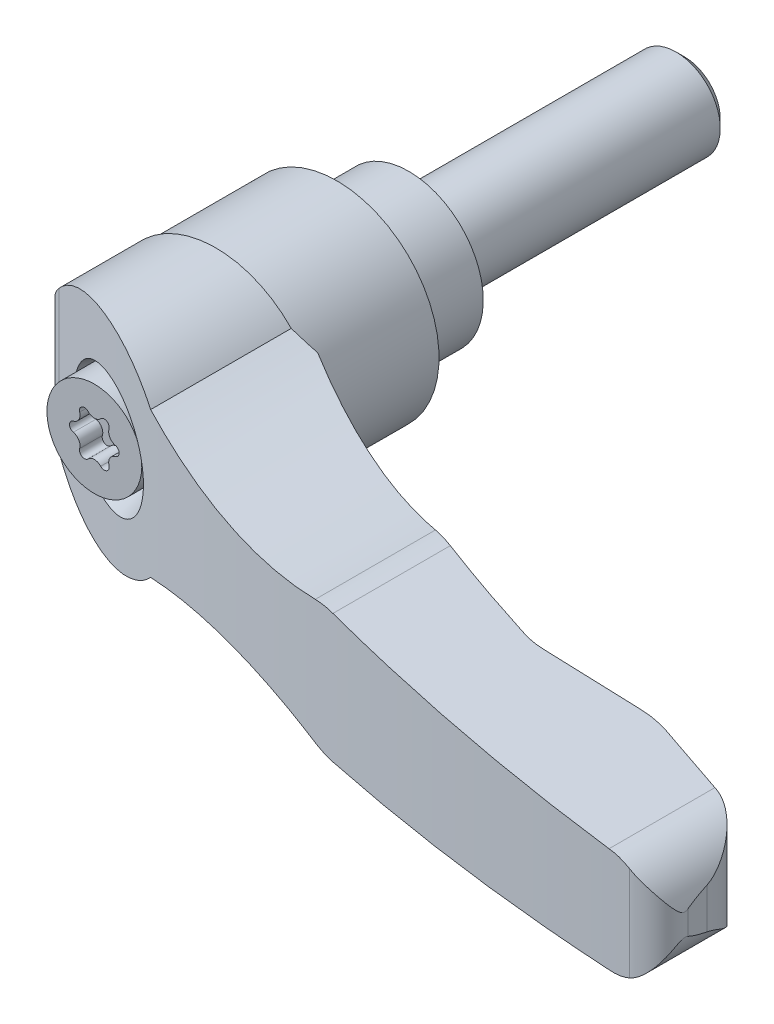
ISO-10303-21;
HEADER;
FILE_DESCRIPTION(('STEP AP214'),'2;1');
FILE_NAME('part.step','',(''),(''),'','','');
FILE_SCHEMA(('AUTOMOTIVE_DESIGN { 1 0 10303 214 1 1 1 1 }'));
ENDSEC;
DATA;
#1=APPLICATION_CONTEXT('core data for automotive mechanical design processes');
#2=APPLICATION_PROTOCOL_DEFINITION('international standard','automotive_design',2000,#1);
#3=PRODUCT_CONTEXT('',#1,'mechanical');
#4=PRODUCT('Part','Part','',(#3));
#5=PRODUCT_RELATED_PRODUCT_CATEGORY('part','',(#4));
#6=PRODUCT_DEFINITION_FORMATION('','',#4);
#7=PRODUCT_DEFINITION_CONTEXT('part definition',#1,'design');
#8=PRODUCT_DEFINITION('design','',#6,#7);
#9=PRODUCT_DEFINITION_SHAPE('','',#8);
#10=(LENGTH_UNIT() NAMED_UNIT(*) SI_UNIT(.MILLI.,.METRE.));
#11=(NAMED_UNIT(*) PLANE_ANGLE_UNIT() SI_UNIT($,.RADIAN.));
#12=(NAMED_UNIT(*) SI_UNIT($,.STERADIAN.) SOLID_ANGLE_UNIT());
#13=UNCERTAINTY_MEASURE_WITH_UNIT(LENGTH_MEASURE(1.E-05),#10,'distance_accuracy_value','');
#14=(GEOMETRIC_REPRESENTATION_CONTEXT(3) GLOBAL_UNCERTAINTY_ASSIGNED_CONTEXT((#13)) GLOBAL_UNIT_ASSIGNED_CONTEXT((#10,
#11,#12)) REPRESENTATION_CONTEXT('',''));
#15=CARTESIAN_POINT('',(0.,0.,0.));
#16=DIRECTION('',(0.,0.,1.));
#17=DIRECTION('',(1.,0.,0.));
#18=AXIS2_PLACEMENT_3D('',#15,#16,#17);
#19=CARTESIAN_POINT('',(0.,0.,-7.116040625));
#20=DIRECTION('',(0.,0.,-1.));
#21=DIRECTION('',(0.,1.,0.));
#22=AXIS2_PLACEMENT_3D('',#19,#20,#21);
#23=CYLINDRICAL_SURFACE('',#22,4.);
#24=CARTESIAN_POINT('',(0.,0.,-24.23));
#25=DIRECTION('',(0.,0.,-1.));
#26=DIRECTION('',(0.,1.,0.));
#27=AXIS2_PLACEMENT_3D('',#24,#25,#26);
#28=CIRCLE('',#27,4.);
#29=CARTESIAN_POINT('',(0.,4.,-24.23));
#30=VERTEX_POINT('',#29);
#31=EDGE_CURVE('E9',#30,#30,#28,.F.);
#32=ORIENTED_EDGE('',*,*,#31,.T.);
#33=EDGE_LOOP('',(#32));
#34=FACE_BOUND('',#33,.T.);
#35=CARTESIAN_POINT('',(0.,0.,0.));
#36=DIRECTION('',(0.,0.,-1.));
#37=DIRECTION('',(0.,1.,0.));
#38=AXIS2_PLACEMENT_3D('',#35,#36,#37);
#39=CIRCLE('',#38,4.);
#40=CARTESIAN_POINT('',(0.,4.,0.));
#41=VERTEX_POINT('',#40);
#42=EDGE_CURVE('E547',#41,#41,#39,.F.);
#43=ORIENTED_EDGE('',*,*,#42,.F.);
#44=EDGE_LOOP('',(#43));
#45=FACE_BOUND('',#44,.T.);
#46=ADVANCED_FACE('F14',(#34,#45),#23,.T.);
#47=CARTESIAN_POINT('',(5.375,0.,0.));
#48=DIRECTION('',(0.,0.,-1.));
#49=DIRECTION('',(0.,1.,0.));
#50=AXIS2_PLACEMENT_3D('',#47,#48,#49);
#51=PLANE('',#50);
#52=ORIENTED_EDGE('',*,*,#42,.T.);
#53=EDGE_LOOP('',(#52));
#54=FACE_BOUND('',#53,.T.);
#55=CARTESIAN_POINT('',(0.,0.,0.));
#56=DIRECTION('',(0.,0.,-1.));
#57=DIRECTION('',(0.,1.,0.));
#58=AXIS2_PLACEMENT_3D('',#55,#56,#57);
#59=CIRCLE('',#58,6.75);
#60=CARTESIAN_POINT('',(0.,6.75,0.));
#61=VERTEX_POINT('',#60);
#62=EDGE_CURVE('E732',#61,#61,#59,.F.);
#63=ORIENTED_EDGE('',*,*,#62,.F.);
#64=EDGE_LOOP('',(#63));
#65=FACE_BOUND('',#64,.T.);
#66=ADVANCED_FACE('F817',(#54,#65),#51,.T.);
#67=CARTESIAN_POINT('',(0.,0.,8.25));
#68=DIRECTION('',(0.,0.,-1.));
#69=DIRECTION('',(0.,1.,0.));
#70=AXIS2_PLACEMENT_3D('',#67,#68,#69);
#71=CYLINDRICAL_SURFACE('',#70,6.75);
#72=ORIENTED_EDGE('',*,*,#62,.T.);
#73=EDGE_LOOP('',(#72));
#74=FACE_BOUND('',#73,.T.);
#75=CARTESIAN_POINT('',(0.,0.,7.15000000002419));
#76=DIRECTION('',(0.,0.,-1.));
#77=DIRECTION('',(1.,0.,0.));
#78=AXIS2_PLACEMENT_3D('',#75,#76,#77);
#79=CIRCLE('',#78,6.74999999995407);
#80=CARTESIAN_POINT('',(6.74999999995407,0.,7.15000000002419));
#81=VERTEX_POINT('',#80);
#82=EDGE_CURVE('E540',#81,#81,#79,.T.);
#83=ORIENTED_EDGE('',*,*,#82,.T.);
#84=EDGE_LOOP('',(#83));
#85=FACE_BOUND('',#84,.T.);
#86=ADVANCED_FACE('F824',(#74,#85),#71,.T.);
#87=CARTESIAN_POINT('',(0.,0.,6.9000000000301));
#88=DIRECTION('',(0.,0.,-1.));
#89=DIRECTION('',(0.,1.,0.));
#90=AXIS2_PLACEMENT_3D('',#87,#88,#89);
#91=CONICAL_SURFACE('',#90,7.000000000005,0.785398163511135);
#92=ORIENTED_EDGE('',*,*,#82,.F.);
#93=EDGE_LOOP('',(#92));
#94=FACE_BOUND('',#93,.T.);
#95=CARTESIAN_POINT('',(0.,0.,6.9));
#96=DIRECTION('',(0.,0.,-1.));
#97=DIRECTION('',(0.,1.,0.));
#98=AXIS2_PLACEMENT_3D('',#95,#96,#97);
#99=CIRCLE('',#98,7.);
#100=CARTESIAN_POINT('',(0.,7.,6.9));
#101=VERTEX_POINT('',#100);
#102=EDGE_CURVE('E536',#101,#101,#99,.T.);
#103=ORIENTED_EDGE('',*,*,#102,.T.);
#104=EDGE_LOOP('',(#103));
#105=FACE_BOUND('',#104,.T.);
#106=ADVANCED_FACE('F832',(#94,#105),#91,.F.);
#107=CARTESIAN_POINT('',(0.,0.,6.2));
#108=DIRECTION('',(0.,0.,-1.));
#109=DIRECTION('',(0.,1.,0.));
#110=AXIS2_PLACEMENT_3D('',#107,#108,#109);
#111=CYLINDRICAL_SURFACE('',#110,7.);
#112=ORIENTED_EDGE('',*,*,#102,.F.);
#113=EDGE_LOOP('',(#112));
#114=FACE_BOUND('',#113,.T.);
#115=CARTESIAN_POINT('',(0.,0.,6.5));
#116=DIRECTION('',(0.,0.,-1.));
#117=DIRECTION('',(0.,1.,0.));
#118=AXIS2_PLACEMENT_3D('',#115,#116,#117);
#119=CIRCLE('',#118,7.);
#120=CARTESIAN_POINT('',(0.,7.,6.5));
#121=VERTEX_POINT('',#120);
#122=EDGE_CURVE('E539',#121,#121,#119,.F.);
#123=ORIENTED_EDGE('',*,*,#122,.F.);
#124=EDGE_LOOP('',(#123));
#125=FACE_BOUND('',#124,.T.);
#126=ADVANCED_FACE('F839',(#114,#125),#111,.F.);
#127=CARTESIAN_POINT('',(-9.01003775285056,-19.,6.5));
#128=DIRECTION('',(0.707106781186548,0.,0.707106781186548));
#129=DIRECTION('',(-0.707106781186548,0.,0.707106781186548));
#130=AXIS2_PLACEMENT_3D('',#127,#128,#129);
#131=PLANE('',#130);
#132=DIRECTION('',(0.,1.,0.));
#133=VECTOR('',#132,1.);
#134=CARTESIAN_POINT('',(-9.01003775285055,0.,6.5));
#135=LINE('',#134,#133);
#136=CARTESIAN_POINT('',(-9.01003775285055,-2.13584185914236,6.5));
#137=VERTEX_POINT('',#136);
#138=CARTESIAN_POINT('',(-9.01003775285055,2.13584185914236,6.5));
#139=VERTEX_POINT('',#138);
#140=EDGE_CURVE('E727',#137,#139,#135,.T.);
#141=ORIENTED_EDGE('',*,*,#140,.F.);
#142=CARTESIAN_POINT('',(-0.00999999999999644,0.,-2.50003775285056));
#143=DIRECTION('',(0.707106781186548,0.,0.707106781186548));
#144=DIRECTION('',(-0.707106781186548,0.,0.707106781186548));
#145=AXIS2_PLACEMENT_3D('',#142,#143,#144);
#146=ELLIPSE('',#145,13.0814754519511,9.25);
#147=EDGE_CURVE('E724',#139,#137,#146,.T.);
#148=ORIENTED_EDGE('',*,*,#147,.F.);
#149=EDGE_LOOP('',(#141,#148));
#150=FACE_BOUND('',#149,.T.);
#151=ADVANCED_FACE('F843',(#150),#131,.F.);
#152=CARTESIAN_POINT('',(-4.635,0.,6.5));
#153=DIRECTION('',(0.,0.,-1.));
#154=DIRECTION('',(0.,1.,0.));
#155=AXIS2_PLACEMENT_3D('',#152,#153,#154);
#156=PLANE('',#155);
#157=ORIENTED_EDGE('',*,*,#140,.T.);
#158=CARTESIAN_POINT('',(-0.00999999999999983,0.,6.5));
#159=DIRECTION('',(0.,0.,1.));
#160=DIRECTION('',(-1.,0.,0.));
#161=AXIS2_PLACEMENT_3D('',#158,#159,#160);
#162=CIRCLE('',#161,9.25);
#163=EDGE_CURVE('E720',#137,#139,#162,.T.);
#164=ORIENTED_EDGE('',*,*,#163,.F.);
#165=EDGE_LOOP('',(#157,#164));
#166=FACE_BOUND('',#165,.T.);
#167=ORIENTED_EDGE('',*,*,#122,.T.);
#168=EDGE_LOOP('',(#167));
#169=FACE_BOUND('',#168,.T.);
#170=ADVANCED_FACE('F847',(#166,#169),#156,.T.);
#171=CARTESIAN_POINT('',(-0.0100000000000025,0.,13.5625));
#172=DIRECTION('',(0.,0.,1.));
#173=DIRECTION('',(-1.,0.,0.));
#174=AXIS2_PLACEMENT_3D('',#171,#172,#173);
#175=CYLINDRICAL_SURFACE('',#174,9.25);
#176=ORIENTED_EDGE('',*,*,#163,.T.);
#177=ORIENTED_EDGE('',*,*,#147,.T.);
#178=EDGE_LOOP('',(#176,#177));
#179=FACE_BOUND('',#178,.T.);
#180=CARTESIAN_POINT('',(-0.010000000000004,0.,17.5));
#181=DIRECTION('',(0.,0.,1.));
#182=DIRECTION('',(-1.,0.,0.));
#183=AXIS2_PLACEMENT_3D('',#180,#181,#182);
#184=CIRCLE('',#183,9.25);
#185=CARTESIAN_POINT('',(-9.26,0.,17.5));
#186=VERTEX_POINT('',#185);
#187=CARTESIAN_POINT('',(9.23999999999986,0.,17.5000000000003));
#188=VERTEX_POINT('',#187);
#189=EDGE_CURVE('E710',#186,#188,#184,.T.);
#190=ORIENTED_EDGE('',*,*,#189,.F.);
#191=CARTESIAN_POINT('',(-0.010000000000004,0.,17.5));
#192=DIRECTION('',(0.,0.,1.));
#193=DIRECTION('',(-1.,0.,0.));
#194=AXIS2_PLACEMENT_3D('',#191,#192,#193);
#195=CIRCLE('',#194,9.25);
#196=EDGE_CURVE('E531',#188,#186,#195,.T.);
#197=ORIENTED_EDGE('',*,*,#196,.F.);
#198=EDGE_LOOP('',(#190,#197));
#199=FACE_BOUND('',#198,.T.);
#200=ADVANCED_FACE('F717',(#179,#199),#175,.T.);
#201=CARTESIAN_POINT('',(64.6274051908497,-10.5,37.5817950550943));
#202=DIRECTION('',(0.992331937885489,0.,-0.123601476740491));
#203=DIRECTION('',(0.123601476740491,0.,0.992331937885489));
#204=AXIS2_PLACEMENT_3D('',#201,#202,#203);
#205=PLANE('',#204);
#206=CARTESIAN_POINT('',(60.25,0.,2.43788666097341));
#207=DIRECTION('',(0.992331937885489,0.,-0.123601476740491));
#208=DIRECTION('',(0.123601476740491,0.,0.992331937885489));
#209=AXIS2_PLACEMENT_3D('',#206,#207,#208);
#210=ELLIPSE('',#209,38.4299615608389,4.75);
#211=CARTESIAN_POINT('',(64.8745408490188,1.08449155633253,39.5659186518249));
#212=VERTEX_POINT('',#211);
#213=CARTESIAN_POINT('',(64.6274051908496,1.84413226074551,37.5817950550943));
#214=VERTEX_POINT('',#213);
#215=EDGE_CURVE('E421',#212,#214,#210,.F.);
#216=ORIENTED_EDGE('',*,*,#215,.F.);
#217=DIRECTION('',(0.,-1.,0.));
#218=VECTOR('',#217,1.);
#219=CARTESIAN_POINT('',(64.8745408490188,-10.5,39.5659186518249));
#220=LINE('',#219,#218);
#221=CARTESIAN_POINT('',(64.8745408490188,-1.08449155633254,39.5659186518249));
#222=VERTEX_POINT('',#221);
#223=EDGE_CURVE('E460',#222,#212,#220,.F.);
#224=ORIENTED_EDGE('',*,*,#223,.F.);
#225=CARTESIAN_POINT('',(60.25,0.,2.43788666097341));
#226=DIRECTION('',(0.992331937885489,0.,-0.123601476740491));
#227=DIRECTION('',(0.123601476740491,0.,0.992331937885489));
#228=AXIS2_PLACEMENT_3D('',#225,#226,#227);
#229=ELLIPSE('',#228,38.4299615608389,4.75);
#230=CARTESIAN_POINT('',(64.6274051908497,-1.84413226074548,37.5817950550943));
#231=VERTEX_POINT('',#230);
#232=EDGE_CURVE('E444',#231,#222,#229,.F.);
#233=ORIENTED_EDGE('',*,*,#232,.F.);
#234=DIRECTION('',(0.,-1.,0.));
#235=VECTOR('',#234,1.);
#236=CARTESIAN_POINT('',(64.6274051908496,-10.5,37.5817950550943));
#237=LINE('',#236,#235);
#238=EDGE_CURVE('E718',#214,#231,#237,.T.);
#239=ORIENTED_EDGE('',*,*,#238,.F.);
#240=EDGE_LOOP('',(#216,#224,#233,#239));
#241=FACE_BOUND('',#240,.T.);
#242=ADVANCED_FACE('F430',(#241),#205,.T.);
#243=CARTESIAN_POINT('',(58.6337202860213,-10.5,38.3283479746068));
#244=DIRECTION('',(0.,-1.,0.));
#245=DIRECTION('',(1.,0.,0.));
#246=AXIS2_PLACEMENT_3D('',#243,#244,#245);
#247=CYLINDRICAL_SURFACE('',#246,6.04);
#248=CARTESIAN_POINT('',(64.6274051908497,1.84413226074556,37.5817950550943));
#249=CARTESIAN_POINT('',(64.6175868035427,1.86745330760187,37.5030045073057));
#250=CARTESIAN_POINT('',(64.6063375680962,1.89362327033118,37.4253204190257));
#251=CARTESIAN_POINT('',(64.5811702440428,1.95049016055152,37.2721928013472));
#252=CARTESIAN_POINT('',(64.5672561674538,1.98118026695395,37.1967460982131));
#253=CARTESIAN_POINT('',(64.5369883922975,2.04585034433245,37.0482136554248));
#254=CARTESIAN_POINT('',(64.520645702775,2.07981523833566,36.9751189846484));
#255=CARTESIAN_POINT('',(64.4855821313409,2.15032519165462,36.8307396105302));
#256=CARTESIAN_POINT('',(64.4668602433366,2.18687133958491,36.7594556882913));
#257=CARTESIAN_POINT('',(64.4072221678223,2.29938724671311,36.547961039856));
#258=CARTESIAN_POINT('',(64.3628565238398,2.37818379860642,36.410218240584));
#259=CARTESIAN_POINT('',(64.2652007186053,2.53960895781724,36.1400450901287));
#260=CARTESIAN_POINT('',(64.2118976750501,2.6222429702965,36.007622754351));
#261=CARTESIAN_POINT('',(64.077119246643,2.81672317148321,35.7040219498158));
#262=CARTESIAN_POINT('',(63.9921849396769,2.92909268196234,35.5347005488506));
#263=CARTESIAN_POINT('',(63.8063278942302,3.15216626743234,35.2039790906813));
#264=CARTESIAN_POINT('',(63.7054078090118,3.26287061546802,35.0425777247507));
#265=CARTESIAN_POINT('',(63.4870671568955,3.47959027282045,34.7278934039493));
#266=CARTESIAN_POINT('',(63.369645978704,3.58560540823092,34.5746107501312));
#267=CARTESIAN_POINT('',(63.1179209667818,3.78996521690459,34.277236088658));
#268=CARTESIAN_POINT('',(62.9836257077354,3.88831374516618,34.1331394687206));
#269=CARTESIAN_POINT('',(62.6561598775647,4.10136712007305,33.815313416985));
#270=CARTESIAN_POINT('',(62.4571888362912,4.21258905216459,33.6450495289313));
#271=CARTESIAN_POINT('',(62.1378586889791,4.36029911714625,33.4069452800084));
#272=CARTESIAN_POINT('',(62.0281124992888,4.40629516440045,33.3305585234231));
#273=CARTESIAN_POINT('',(61.8018114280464,4.49098569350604,33.1841350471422));
#274=CARTESIAN_POINT('',(61.6852609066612,4.52968478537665,33.1140943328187));
#275=CARTESIAN_POINT('',(61.4786111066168,4.58924867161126,32.9993621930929));
#276=CARTESIAN_POINT('',(61.3900115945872,4.61209493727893,32.9529824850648));
#277=CARTESIAN_POINT('',(61.2097340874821,4.65295056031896,32.8642982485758));
#278=CARTESIAN_POINT('',(61.1180570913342,4.67096147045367,32.82199241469));
#279=CARTESIAN_POINT('',(60.9313596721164,4.70183469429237,32.7415027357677));
#280=CARTESIAN_POINT('',(60.8363219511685,4.71466416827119,32.7033462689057));
#281=CARTESIAN_POINT('',(60.6438287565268,4.73463763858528,32.631712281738));
#282=CARTESIAN_POINT('',(60.5463713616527,4.74177695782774,32.5982386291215));
#283=CARTESIAN_POINT('',(60.4479724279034,4.74587261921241,32.5672639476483));
#284=B_SPLINE_CURVE_WITH_KNOTS('',3,(#248,#249,#250,#251,#252,#253,#254,#255,#256,#257,#258,
#259,#260,#261,#262,#263,#264,#265,#266,#267,#268,#269,#270,#271,#272,#273,#274,#275,#276,#277,
#278,#279,#280,#281,#282,#283),.UNSPECIFIED.,.F.,.F.,(4,2,2,2,2,2,2,2,2,2,2,2,2,2,2,2,2,4),(0.,
0.248076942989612,0.495783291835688,0.742399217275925,0.989119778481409,1.48293160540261,
1.97746142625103,2.63745339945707,3.29733594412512,3.95724294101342,4.61681594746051,
5.46693586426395,5.89075482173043,6.31430511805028,6.62183365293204,6.92926331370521,
7.23861197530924,7.54821464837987),.UNSPECIFIED.);
#285=CARTESIAN_POINT('',(60.4479724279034,4.74587261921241,32.5672639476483));
#286=VERTEX_POINT('',#285);
#287=EDGE_CURVE('E412',#214,#286,#284,.T.);
#288=ORIENTED_EDGE('',*,*,#287,.F.);
#289=ORIENTED_EDGE('',*,*,#238,.T.);
#290=CARTESIAN_POINT('',(60.4479724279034,-4.74587261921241,32.5672639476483));
#291=CARTESIAN_POINT('',(60.5755504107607,-4.74057354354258,32.6074069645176));
#292=CARTESIAN_POINT('',(60.7015088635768,-4.73014540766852,32.6517620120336));
#293=CARTESIAN_POINT('',(60.9490652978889,-4.69992242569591,32.7481786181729));
#294=CARTESIAN_POINT('',(61.0706698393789,-4.6801423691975,32.8002279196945));
#295=CARTESIAN_POINT('',(61.3074659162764,-4.63235500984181,32.9108206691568));
#296=CARTESIAN_POINT('',(61.4227141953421,-4.60444273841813,32.9692844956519));
#297=CARTESIAN_POINT('',(61.6477173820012,-4.54120548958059,33.0925213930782));
#298=CARTESIAN_POINT('',(61.7574696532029,-4.50587699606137,33.1572974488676));
#299=CARTESIAN_POINT('',(61.9940137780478,-4.42040174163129,33.307032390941));
#300=CARTESIAN_POINT('',(62.1193938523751,-4.36870213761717,33.3933358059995));
#301=CARTESIAN_POINT('',(62.3610721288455,-4.25718277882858,33.5732278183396));
#302=CARTESIAN_POINT('',(62.4773638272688,-4.19735729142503,33.6668215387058));
#303=CARTESIAN_POINT('',(62.7012840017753,-4.07066877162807,33.8608437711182));
#304=CARTESIAN_POINT('',(62.8088611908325,-4.0037687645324,33.9613071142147));
#305=CARTESIAN_POINT('',(63.0146476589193,-3.86453813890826,34.1677809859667));
#306=CARTESIAN_POINT('',(63.1128596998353,-3.79220913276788,34.2737898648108));
#307=CARTESIAN_POINT('',(63.3331746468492,-3.61700510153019,34.5290929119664));
#308=CARTESIAN_POINT('',(63.4514763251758,-3.51235864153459,34.6804594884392));
#309=CARTESIAN_POINT('',(63.6718053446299,-3.29808480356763,34.9913387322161));
#310=CARTESIAN_POINT('',(63.7738256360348,-3.18845529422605,35.1508548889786));
#311=CARTESIAN_POINT('',(63.961662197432,-2.9676568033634,35.4770445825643));
#312=CARTESIAN_POINT('',(64.0475378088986,-2.85649513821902,35.6436890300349));
#313=CARTESIAN_POINT('',(64.2038484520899,-2.63586419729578,35.9851508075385));
#314=CARTESIAN_POINT('',(64.2742871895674,-2.52639452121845,36.1599661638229));
#315=CARTESIAN_POINT('',(64.3705847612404,-2.36382517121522,36.4361542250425));
#316=CARTESIAN_POINT('',(64.4019853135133,-2.30809068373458,36.5340606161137));
#317=CARTESIAN_POINT('',(64.4601539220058,-2.20019362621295,36.7330390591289));
#318=CARTESIAN_POINT('',(64.4869269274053,-2.14802727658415,36.8341075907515));
#319=CARTESIAN_POINT('',(64.5357331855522,-2.04890785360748,37.0402846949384));
#320=CARTESIAN_POINT('',(64.5577546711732,-2.00196785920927,37.1454025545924));
#321=CARTESIAN_POINT('',(64.596614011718,-1.91618262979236,37.360168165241));
#322=CARTESIAN_POINT('',(64.6134353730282,-1.87736327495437,37.4698291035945));
#323=CARTESIAN_POINT('',(64.6274051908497,-1.84413226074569,37.5817950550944));
#324=B_SPLINE_CURVE_WITH_KNOTS('',3,(#290,#291,#292,#293,#294,#295,#296,#297,#298,#299,#300,
#301,#302,#303,#304,#305,#306,#307,#308,#309,#310,#311,#312,#313,#314,#315,#316,#317,#318,#319,
#320,#321,#322,#323),.UNSPECIFIED.,.F.,.F.,(4,2,2,2,2,2,2,2,2,2,2,2,2,2,2,2,4),(0.,
0.401264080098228,0.801895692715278,1.19802151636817,1.59433557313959,2.0758833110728,
2.55777255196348,3.04231807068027,3.52672024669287,4.18208013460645,4.83772302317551,
5.49090678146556,6.1439335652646,6.49464389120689,6.84497677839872,7.19616755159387,
7.54846105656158),.UNSPECIFIED.);
#325=CARTESIAN_POINT('',(60.4479724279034,-4.74587261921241,32.5672639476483));
#326=VERTEX_POINT('',#325);
#327=EDGE_CURVE('E436',#326,#231,#324,.T.);
#328=ORIENTED_EDGE('',*,*,#327,.F.);
#329=DIRECTION('',(0.,-1.,0.));
#330=VECTOR('',#329,1.);
#331=CARTESIAN_POINT('',(60.4479724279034,-10.5,32.5672639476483));
#332=LINE('',#331,#330);
#333=EDGE_CURVE('E526',#286,#326,#332,.T.);
#334=ORIENTED_EDGE('',*,*,#333,.F.);
#335=EDGE_LOOP('',(#288,#289,#328,#334));
#336=FACE_BOUND('',#335,.T.);
#337=ADVANCED_FACE('F424',(#336),#247,.T.);
#338=CARTESIAN_POINT('',(-9.26,-10.5,17.5));
#339=DIRECTION('',(0.,0.,-1.));
#340=DIRECTION('',(0.,1.,0.));
#341=AXIS2_PLACEMENT_3D('',#338,#339,#340);
#342=PLANE('',#341);
#343=DIRECTION('',(0.,-1.,0.));
#344=VECTOR('',#343,1.);
#345=CARTESIAN_POINT('',(-9.26,-10.5,17.5));
#346=LINE('',#345,#344);
#347=CARTESIAN_POINT('',(-9.26,2.12188595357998,17.5));
#348=VERTEX_POINT('',#347);
#349=EDGE_CURVE('E527',#348,#186,#346,.T.);
#350=ORIENTED_EDGE('',*,*,#349,.F.);
#351=CARTESIAN_POINT('',(0.,0.,17.5));
#352=DIRECTION('',(0.,0.,1.));
#353=DIRECTION('',(0.,-1.,0.));
#354=AXIS2_PLACEMENT_3D('',#351,#352,#353);
#355=CIRCLE('',#354,9.5);
#356=CARTESIAN_POINT('',(6.84374087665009,6.58887022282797,17.5));
#357=VERTEX_POINT('',#356);
#358=EDGE_CURVE('E338',#357,#348,#355,.T.);
#359=ORIENTED_EDGE('',*,*,#358,.F.);
#360=CARTESIAN_POINT('',(19.25,44.09,17.5));
#361=DIRECTION('',(0.,0.,1.));
#362=DIRECTION('',(0.,-1.,0.));
#363=AXIS2_PLACEMENT_3D('',#360,#361,#362);
#364=CIRCLE('',#363,39.5);
#365=CARTESIAN_POINT('',(9.23999999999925,5.87940068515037,17.5000000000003));
#366=VERTEX_POINT('',#365);
#367=EDGE_CURVE('E339',#357,#366,#364,.T.);
#368=ORIENTED_EDGE('',*,*,#367,.T.);
#369=DIRECTION('',(0.,-1.,0.));
#370=VECTOR('',#369,1.);
#371=CARTESIAN_POINT('',(9.23999999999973,-10.5,17.5000000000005));
#372=LINE('',#371,#370);
#373=EDGE_CURVE('E471',#366,#188,#372,.T.);
#374=ORIENTED_EDGE('',*,*,#373,.T.);
#375=ORIENTED_EDGE('',*,*,#196,.T.);
#376=EDGE_LOOP('',(#350,#359,#368,#374,#375));
#377=FACE_BOUND('',#376,.T.);
#378=ADVANCED_FACE('F429',(#377),#342,.T.);
#379=CARTESIAN_POINT('',(-9.26,-10.5,21.2038249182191));
#380=DIRECTION('',(-1.,0.,0.));
#381=DIRECTION('',(0.,-1.,0.));
#382=AXIS2_PLACEMENT_3D('',#379,#380,#381);
#383=PLANE('',#382);
#384=ORIENTED_EDGE('',*,*,#349,.T.);
#385=DIRECTION('',(0.,1.,0.));
#386=VECTOR('',#385,1.);
#387=CARTESIAN_POINT('',(-9.26,-10.5,17.5));
#388=LINE('',#387,#386);
#389=CARTESIAN_POINT('',(-9.26,-2.12188595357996,17.5));
#390=VERTEX_POINT('',#389);
#391=EDGE_CURVE('E706',#390,#186,#388,.T.);
#392=ORIENTED_EDGE('',*,*,#391,.F.);
#393=DIRECTION('',(0.,0.,1.));
#394=VECTOR('',#393,1.);
#395=CARTESIAN_POINT('',(-9.26,-2.12188595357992,42.5));
#396=LINE('',#395,#394);
#397=CARTESIAN_POINT('',(-9.26,-2.12188595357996,21.2038249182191));
#398=VERTEX_POINT('',#397);
#399=EDGE_CURVE('E530',#398,#390,#396,.F.);
#400=ORIENTED_EDGE('',*,*,#399,.F.);
#401=DIRECTION('',(0.,-1.,0.));
#402=VECTOR('',#401,1.);
#403=CARTESIAN_POINT('',(-9.26,-10.5,21.2038249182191));
#404=LINE('',#403,#402);
#405=CARTESIAN_POINT('',(-9.26,2.12188595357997,21.2038249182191));
#406=VERTEX_POINT('',#405);
#407=EDGE_CURVE('E493',#406,#398,#404,.T.);
#408=ORIENTED_EDGE('',*,*,#407,.F.);
#409=DIRECTION('',(0.,0.,1.));
#410=VECTOR('',#409,1.);
#411=CARTESIAN_POINT('',(-9.26,2.12188595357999,42.5));
#412=LINE('',#411,#410);
#413=EDGE_CURVE('E491',#348,#406,#412,.T.);
#414=ORIENTED_EDGE('',*,*,#413,.F.);
#415=EDGE_LOOP('',(#384,#392,#400,#408,#414));
#416=FACE_BOUND('',#415,.T.);
#417=ADVANCED_FACE('F708',(#416),#383,.T.);
#418=CARTESIAN_POINT('',(-9.26,-10.5,17.5));
#419=DIRECTION('',(0.,0.,-1.));
#420=DIRECTION('',(0.,1.,0.));
#421=AXIS2_PLACEMENT_3D('',#418,#419,#420);
#422=PLANE('',#421);
#423=DIRECTION('',(0.,-1.,0.));
#424=VECTOR('',#423,1.);
#425=CARTESIAN_POINT('',(9.23999999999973,-10.5,17.5000000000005));
#426=LINE('',#425,#424);
#427=CARTESIAN_POINT('',(9.23999999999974,-5.87940068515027,17.5000000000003));
#428=VERTEX_POINT('',#427);
#429=EDGE_CURVE('E639',#188,#428,#426,.T.);
#430=ORIENTED_EDGE('',*,*,#429,.T.);
#431=CARTESIAN_POINT('',(19.25,-44.09,17.5));
#432=DIRECTION('',(0.,0.,1.));
#433=DIRECTION('',(0.,-1.,0.));
#434=AXIS2_PLACEMENT_3D('',#431,#432,#433);
#435=CIRCLE('',#434,39.5);
#436=CARTESIAN_POINT('',(6.84374087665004,-6.588870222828,17.5));
#437=VERTEX_POINT('',#436);
#438=EDGE_CURVE('E305',#428,#437,#435,.T.);
#439=ORIENTED_EDGE('',*,*,#438,.T.);
#440=CARTESIAN_POINT('',(0.,0.,17.5));
#441=DIRECTION('',(0.,0.,1.));
#442=DIRECTION('',(0.,-1.,0.));
#443=AXIS2_PLACEMENT_3D('',#440,#441,#442);
#444=CIRCLE('',#443,9.5);
#445=EDGE_CURVE('E496',#390,#437,#444,.T.);
#446=ORIENTED_EDGE('',*,*,#445,.F.);
#447=ORIENTED_EDGE('',*,*,#391,.T.);
#448=ORIENTED_EDGE('',*,*,#189,.T.);
#449=EDGE_LOOP('',(#430,#439,#446,#447,#448));
#450=FACE_BOUND('',#449,.T.);
#451=ADVANCED_FACE('F701',(#450),#422,.T.);
#452=CARTESIAN_POINT('',(53.8294507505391,-10.5,30.4829917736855));
#453=DIRECTION('',(0.300372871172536,0.,-0.95382185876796));
#454=DIRECTION('',(0.95382185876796,0.,0.300372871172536));
#455=AXIS2_PLACEMENT_3D('',#452,#453,#454);
#456=PLANE('',#455);
#457=CARTESIAN_POINT('',(60.25,0.,32.5049194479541));
#458=DIRECTION('',(0.300372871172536,0.,-0.95382185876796));
#459=DIRECTION('',(0.95382185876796,0.,0.300372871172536));
#460=AXIS2_PLACEMENT_3D('',#457,#458,#459);
#461=ELLIPSE('',#460,4.97996555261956,4.75);
#462=CARTESIAN_POINT('',(60.25,4.75,32.5049194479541));
#463=VERTEX_POINT('',#462);
#464=EDGE_CURVE('E461',#286,#463,#461,.F.);
#465=ORIENTED_EDGE('',*,*,#464,.F.);
#466=ORIENTED_EDGE('',*,*,#333,.T.);
#467=CARTESIAN_POINT('',(60.25,0.,32.5049194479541));
#468=DIRECTION('',(0.300372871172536,0.,-0.95382185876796));
#469=DIRECTION('',(0.95382185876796,0.,0.300372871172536));
#470=AXIS2_PLACEMENT_3D('',#467,#468,#469);
#471=ELLIPSE('',#470,4.97996555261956,4.75);
#472=CARTESIAN_POINT('',(60.25,-4.75,32.5049194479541));
#473=VERTEX_POINT('',#472);
#474=EDGE_CURVE('E445',#473,#326,#471,.F.);
#475=ORIENTED_EDGE('',*,*,#474,.F.);
#476=DIRECTION('',(-0.953255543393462,-0.0344545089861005,-0.300194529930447));
#477=VECTOR('',#476,1.);
#478=CARTESIAN_POINT('',(60.25,-4.75,32.5049194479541));
#479=LINE('',#478,#477);
#480=CARTESIAN_POINT('',(53.8294507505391,-4.98206460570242,30.4829917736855));
#481=VERTEX_POINT('',#480);
#482=EDGE_CURVE('E508',#473,#481,#479,.T.);
#483=ORIENTED_EDGE('',*,*,#482,.T.);
#484=DIRECTION('',(0.,-1.,0.));
#485=VECTOR('',#484,1.);
#486=CARTESIAN_POINT('',(53.8294507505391,-10.5,30.4829917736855));
#487=LINE('',#486,#485);
#488=CARTESIAN_POINT('',(53.8294507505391,4.98206460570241,30.4829917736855));
#489=VERTEX_POINT('',#488);
#490=EDGE_CURVE('E523',#489,#481,#487,.T.);
#491=ORIENTED_EDGE('',*,*,#490,.F.);
#492=DIRECTION('',(0.953255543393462,-0.0344545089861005,0.300194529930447));
#493=VECTOR('',#492,1.);
#494=CARTESIAN_POINT('',(53.8294507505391,4.98206460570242,30.4829917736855));
#495=LINE('',#494,#493);
#496=EDGE_CURVE('E473',#489,#463,#495,.T.);
#497=ORIENTED_EDGE('',*,*,#496,.T.);
#498=EDGE_LOOP('',(#465,#466,#475,#483,#491,#497));
#499=FACE_BOUND('',#498,.T.);
#500=ADVANCED_FACE('F868',(#499),#456,.T.);
#501=CARTESIAN_POINT('',(51.0780352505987,-10.5,39.22));
#502=DIRECTION('',(0.,-1.,0.));
#503=DIRECTION('',(1.,0.,0.));
#504=AXIS2_PLACEMENT_3D('',#501,#502,#503);
#505=CYLINDRICAL_SURFACE('',#504,9.15999999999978);
#506=CARTESIAN_POINT('',(51.0780352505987,5.08151188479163,39.22));
#507=DIRECTION('',(-0.0361204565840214,-0.999347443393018,0.));
#508=DIRECTION('',(0.999347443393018,-0.0361204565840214,0.));
#509=AXIS2_PLACEMENT_3D('',#506,#507,#508);
#510=ELLIPSE('',#509,9.16598132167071,9.15999999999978);
#511=CARTESIAN_POINT('',(51.0780352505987,5.08151188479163,30.06));
#512=VERTEX_POINT('',#511);
#513=EDGE_CURVE('E476',#512,#489,#510,.T.);
#514=ORIENTED_EDGE('',*,*,#513,.T.);
#515=ORIENTED_EDGE('',*,*,#490,.T.);
#516=CARTESIAN_POINT('',(51.0780352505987,-5.08151188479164,39.22));
#517=DIRECTION('',(-0.0361204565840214,0.999347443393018,0.));
#518=DIRECTION('',(-0.999347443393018,-0.0361204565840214,0.));
#519=AXIS2_PLACEMENT_3D('',#516,#517,#518);
#520=ELLIPSE('',#519,9.16598132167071,9.15999999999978);
#521=CARTESIAN_POINT('',(51.0780352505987,-5.08151188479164,30.06));
#522=VERTEX_POINT('',#521);
#523=EDGE_CURVE('E303',#481,#522,#520,.T.);
#524=ORIENTED_EDGE('',*,*,#523,.T.);
#525=DIRECTION('',(0.,1.,0.));
#526=VECTOR('',#525,1.);
#527=CARTESIAN_POINT('',(51.0780352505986,-10.5,30.06));
#528=LINE('',#527,#526);
#529=EDGE_CURVE('E520',#512,#522,#528,.F.);
#530=ORIENTED_EDGE('',*,*,#529,.F.);
#531=EDGE_LOOP('',(#514,#515,#524,#530));
#532=FACE_BOUND('',#531,.T.);
#533=ADVANCED_FACE('F877',(#532),#505,.T.);
#534=CARTESIAN_POINT('',(42.239481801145,-10.5,30.06));
#535=DIRECTION('',(0.,0.,-1.));
#536=DIRECTION('',(0.,1.,0.));
#537=AXIS2_PLACEMENT_3D('',#534,#535,#536);
#538=PLANE('',#537);
#539=DIRECTION('',(0.999347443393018,-0.0361204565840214,0.));
#540=VECTOR('',#539,1.);
#541=CARTESIAN_POINT('',(30.3472861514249,5.83080496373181,30.06));
#542=LINE('',#541,#540);
#543=CARTESIAN_POINT('',(42.239481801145,5.4009729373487,30.06));
#544=VERTEX_POINT('',#543);
#545=EDGE_CURVE('E477',#544,#512,#542,.T.);
#546=ORIENTED_EDGE('',*,*,#545,.T.);
#547=ORIENTED_EDGE('',*,*,#529,.T.);
#548=DIRECTION('',(-0.999347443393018,-0.0361204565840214,0.));
#549=VECTOR('',#548,1.);
#550=CARTESIAN_POINT('',(60.25,-4.75,30.06));
#551=LINE('',#550,#549);
#552=CARTESIAN_POINT('',(42.239481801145,-5.4009729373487,30.06));
#553=VERTEX_POINT('',#552);
#554=EDGE_CURVE('E505',#522,#553,#551,.T.);
#555=ORIENTED_EDGE('',*,*,#554,.T.);
#556=DIRECTION('',(0.,-1.,0.));
#557=VECTOR('',#556,1.);
#558=CARTESIAN_POINT('',(42.239481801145,-10.5,30.06));
#559=LINE('',#558,#557);
#560=EDGE_CURVE('E518',#553,#544,#559,.F.);
#561=ORIENTED_EDGE('',*,*,#560,.T.);
#562=EDGE_LOOP('',(#546,#547,#555,#561));
#563=FACE_BOUND('',#562,.T.);
#564=ADVANCED_FACE('F880',(#563),#538,.T.);
#565=CARTESIAN_POINT('',(42.2394818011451,-10.5,23.0799999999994));
#566=DIRECTION('',(0.,-1.,0.));
#567=DIRECTION('',(1.,0.,0.));
#568=AXIS2_PLACEMENT_3D('',#565,#566,#567);
#569=CYLINDRICAL_SURFACE('',#568,6.98000000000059);
#570=DIRECTION('',(0.,-1.,0.));
#571=VECTOR('',#570,1.);
#572=CARTESIAN_POINT('',(40.3024609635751,-10.5,29.785844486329));
#573=LINE('',#572,#571);
#574=CARTESIAN_POINT('',(40.3024609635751,-5.47098470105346,29.7858444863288));
#575=VERTEX_POINT('',#574);
#576=CARTESIAN_POINT('',(40.3024609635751,5.47098470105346,29.7858444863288));
#577=VERTEX_POINT('',#576);
#578=EDGE_CURVE('E535',#575,#577,#573,.F.);
#579=ORIENTED_EDGE('',*,*,#578,.T.);
#580=CARTESIAN_POINT('',(42.2394818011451,5.40097293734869,23.0799999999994));
#581=DIRECTION('',(-0.0361204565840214,-0.999347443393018,0.));
#582=DIRECTION('',(0.999347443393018,-0.0361204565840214,0.));
#583=AXIS2_PLACEMENT_3D('',#580,#581,#582);
#584=ELLIPSE('',#583,6.98455781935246,6.98000000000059);
#585=EDGE_CURVE('E480',#577,#544,#584,.F.);
#586=ORIENTED_EDGE('',*,*,#585,.T.);
#587=ORIENTED_EDGE('',*,*,#560,.F.);
#588=CARTESIAN_POINT('',(42.2394818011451,-5.4009729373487,23.0799999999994));
#589=DIRECTION('',(-0.0361204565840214,0.999347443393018,0.));
#590=DIRECTION('',(-0.999347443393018,-0.0361204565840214,0.));
#591=AXIS2_PLACEMENT_3D('',#588,#589,#590);
#592=ELLIPSE('',#591,6.98455781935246,6.98000000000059);
#593=EDGE_CURVE('E507',#553,#575,#592,.F.);
#594=ORIENTED_EDGE('',*,*,#593,.T.);
#595=EDGE_LOOP('',(#579,#586,#587,#594));
#596=FACE_BOUND('',#595,.T.);
#597=ADVANCED_FACE('F313',(#596),#569,.F.);
#598=CARTESIAN_POINT('',(88.9416647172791,-10.5,-138.600024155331));
#599=DIRECTION('',(0.,-1.,0.));
#600=DIRECTION('',(1.,0.,0.));
#601=AXIS2_PLACEMENT_3D('',#598,#599,#600);
#602=CYLINDRICAL_SURFACE('',#601,175.27);
#603=CARTESIAN_POINT('',(30.3472861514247,5.83080496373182,26.5855433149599));
#604=CARTESIAN_POINT('',(30.1696679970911,5.83722947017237,26.5225405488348));
#605=CARTESIAN_POINT('',(29.9919650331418,5.83772087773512,26.45918181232));
#606=CARTESIAN_POINT('',(29.6377732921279,5.82691956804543,26.3322542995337));
#607=CARTESIAN_POINT('',(29.461282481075,5.81567269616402,26.2686872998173));
#608=CARTESIAN_POINT('',(29.1095062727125,5.78152581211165,26.1413510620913));
#609=CARTESIAN_POINT('',(28.9342208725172,5.75862582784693,26.0775818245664));
#610=CARTESIAN_POINT('',(28.5848474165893,5.70116062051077,25.9498538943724));
#611=CARTESIAN_POINT('',(28.4107667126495,5.6665501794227,25.8858954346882));
#612=CARTESIAN_POINT('',(28.2379732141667,5.62616845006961,25.8220994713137));
#613=B_SPLINE_CURVE_WITH_KNOTS('',3,(#603,#604,#605,#606,#607,#608,#609,#610,#611,#612),
.UNSPECIFIED.,.F.,.F.,(4,2,2,2,4),(0.,0.565613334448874,1.1290258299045,1.69243697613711,
2.2580489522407),.UNSPECIFIED.);
#614=CARTESIAN_POINT('',(30.3472861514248,5.83080496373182,26.5855433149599));
#615=VERTEX_POINT('',#614);
#616=CARTESIAN_POINT('',(28.2379732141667,5.62616845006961,25.8220994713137));
#617=VERTEX_POINT('',#616);
#618=EDGE_CURVE('E475',#615,#617,#613,.T.);
#619=ORIENTED_EDGE('',*,*,#618,.F.);
#620=CARTESIAN_POINT('',(88.9416647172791,3.71296724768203,-138.600024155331));
#621=DIRECTION('',(-0.0361204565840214,-0.999347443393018,0.));
#622=DIRECTION('',(0.999347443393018,-0.0361204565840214,0.));
#623=AXIS2_PLACEMENT_3D('',#620,#621,#622);
#624=ELLIPSE('',#623,175.384448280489,175.27);
#625=EDGE_CURVE('E422',#615,#577,#624,.F.);
#626=ORIENTED_EDGE('',*,*,#625,.T.);
#627=ORIENTED_EDGE('',*,*,#578,.F.);
#628=CARTESIAN_POINT('',(88.9416647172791,-3.71296724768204,-138.600024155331));
#629=DIRECTION('',(-0.0361204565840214,0.999347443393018,0.));
#630=DIRECTION('',(-0.999347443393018,-0.0361204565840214,0.));
#631=AXIS2_PLACEMENT_3D('',#628,#629,#630);
#632=ELLIPSE('',#631,175.384448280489,175.27);
#633=CARTESIAN_POINT('',(30.3472861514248,-5.83080496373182,26.5855433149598));
#634=VERTEX_POINT('',#633);
#635=EDGE_CURVE('E504',#575,#634,#632,.F.);
#636=ORIENTED_EDGE('',*,*,#635,.T.);
#637=CARTESIAN_POINT('',(28.237973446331,-5.6261685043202,25.8220995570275));
#638=CARTESIAN_POINT('',(28.4107669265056,-5.66655022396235,25.8858955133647));
#639=CARTESIAN_POINT('',(28.584847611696,-5.70116065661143,25.9498539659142));
#640=CARTESIAN_POINT('',(28.9342210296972,-5.75862584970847,26.0775818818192));
#641=CARTESIAN_POINT('',(29.1095064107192,-5.78152582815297,26.1413511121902));
#642=CARTESIAN_POINT('',(29.461282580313,-5.81567270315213,26.2686873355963));
#643=CARTESIAN_POINT('',(29.6377733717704,-5.82691957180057,26.3322543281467));
#644=CARTESIAN_POINT('',(29.9919650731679,-5.83772087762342,26.4591818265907));
#645=CARTESIAN_POINT('',(30.169668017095,-5.83722946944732,26.5225405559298));
#646=CARTESIAN_POINT('',(30.3472861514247,-5.83080496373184,26.5855433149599));
#647=B_SPLINE_CURVE_WITH_KNOTS('',3,(#637,#638,#639,#640,#641,#642,#643,#644,#645,#646),
.UNSPECIFIED.,.F.,.F.,(4,2,2,2,4),(0.,0.565611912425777,1.12902299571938,1.69243542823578,
2.25804869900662),.UNSPECIFIED.);
#648=CARTESIAN_POINT('',(28.237973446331,-5.6261685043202,25.8220995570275));
#649=VERTEX_POINT('',#648);
#650=EDGE_CURVE('E293',#649,#634,#647,.T.);
#651=ORIENTED_EDGE('',*,*,#650,.F.);
#652=CARTESIAN_POINT('',(28.237973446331,-5.6261685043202,25.8220995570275));
#653=CARTESIAN_POINT('',(27.6467124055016,-5.48799745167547,25.6038196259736));
#654=CARTESIAN_POINT('',(27.0537779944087,-5.36383084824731,25.3812778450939));
#655=CARTESIAN_POINT('',(25.8659006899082,-5.14331117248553,24.9280288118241));
#656=CARTESIAN_POINT('',(25.2709579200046,-5.04695642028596,24.6973220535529));
#657=CARTESIAN_POINT('',(24.0803912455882,-4.88185687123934,24.2280988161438));
#658=CARTESIAN_POINT('',(23.4847674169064,-4.81310925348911,23.9895831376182));
#659=CARTESIAN_POINT('',(22.2940534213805,-4.70292970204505,23.5051335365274));
#660=CARTESIAN_POINT('',(21.6989632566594,-4.66149787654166,23.2591995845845));
#661=CARTESIAN_POINT('',(19.93823636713,-4.57874286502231,22.520112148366));
#662=CARTESIAN_POINT('',(18.7748149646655,-4.57591682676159,22.0168726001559));
#663=CARTESIAN_POINT('',(16.4631439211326,-4.67145944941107,20.9870607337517));
#664=CARTESIAN_POINT('',(15.3148886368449,-4.76978933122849,20.4604974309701));
#665=CARTESIAN_POINT('',(13.7610005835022,-4.97097993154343,19.7276539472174));
#666=CARTESIAN_POINT('',(13.3455946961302,-5.03153416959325,19.5297267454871));
#667=CARTESIAN_POINT('',(12.518128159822,-5.16561835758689,19.1314774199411));
#668=CARTESIAN_POINT('',(12.1060667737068,-5.23914536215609,18.9311558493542));
#669=CARTESIAN_POINT('',(11.282699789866,-5.39957122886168,18.526898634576));
#670=CARTESIAN_POINT('',(10.8714191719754,-5.48655913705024,18.3229475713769));
#671=CARTESIAN_POINT('',(10.0527171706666,-5.67338492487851,17.9129677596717));
#672=CARTESIAN_POINT('',(9.64529662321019,-5.77322552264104,17.7069385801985));
#673=CARTESIAN_POINT('',(9.23999999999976,-5.87940068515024,17.5000000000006));
#674=B_SPLINE_CURVE_WITH_KNOTS('',3,(#652,#653,#654,#655,#656,#657,#658,#659,#660,#661,#662,
#663,#664,#665,#666,#667,#668,#669,#670,#671,#672,#673),.UNSPECIFIED.,.F.,.F.,(4,2,2,2,2,2,2,2,
2,2,4),(0.,1.93549726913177,3.87087760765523,5.80606013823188,7.74125033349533,11.5393004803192,
15.3358951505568,16.7281050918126,18.1199993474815,19.5215293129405,20.9233561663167),.UNSPECIFIED.);
#675=EDGE_CURVE('E320',#649,#428,#674,.T.);
#676=ORIENTED_EDGE('',*,*,#675,.T.);
#677=ORIENTED_EDGE('',*,*,#429,.F.);
#678=ORIENTED_EDGE('',*,*,#373,.F.);
#679=CARTESIAN_POINT('',(9.23999999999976,5.87940068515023,17.5000000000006));
#680=CARTESIAN_POINT('',(9.79948003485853,5.73283344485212,17.7856672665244));
#681=CARTESIAN_POINT('',(10.363016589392,5.598336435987,18.0695987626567));
#682=CARTESIAN_POINT('',(11.4974282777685,5.35391463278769,18.6334448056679));
#683=CARTESIAN_POINT('',(12.068303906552,5.24399150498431,18.9133590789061));
#684=CARTESIAN_POINT('',(13.2171050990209,5.04907387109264,19.4688580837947));
#685=CARTESIAN_POINT('',(13.795037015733,4.9641038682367,19.7444383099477));
#686=CARTESIAN_POINT('',(14.9564491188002,4.81968144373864,20.2904183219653));
#687=CARTESIAN_POINT('',(15.5399291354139,4.7602282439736,20.5608182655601));
#688=CARTESIAN_POINT('',(17.2745449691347,4.62260622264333,21.3530632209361));
#689=CARTESIAN_POINT('',(18.4324989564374,4.58133087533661,21.8669029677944));
#690=CARTESIAN_POINT('',(20.7578250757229,4.60168529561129,22.8686662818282));
#691=CARTESIAN_POINT('',(21.9251896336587,4.66323920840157,23.3566086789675));
#692=CARTESIAN_POINT('',(23.5210667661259,4.81923174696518,24.0035807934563));
#693=CARTESIAN_POINT('',(23.9492706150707,4.86815261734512,24.1752006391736));
#694=CARTESIAN_POINT('',(24.8053597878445,4.98022825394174,24.5144113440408));
#695=CARTESIAN_POINT('',(25.2332451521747,5.04338070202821,24.6820028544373));
#696=CARTESIAN_POINT('',(26.0913485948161,5.18451987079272,25.01422907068));
#697=CARTESIAN_POINT('',(26.5215612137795,5.26261039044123,25.1788336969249));
#698=CARTESIAN_POINT('',(27.3808010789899,5.43340909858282,25.5037362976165));
#699=CARTESIAN_POINT('',(27.8098280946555,5.52611995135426,25.6640334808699));
#700=CARTESIAN_POINT('',(28.2379732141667,5.6261684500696,25.8220994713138));
#701=B_SPLINE_CURVE_WITH_KNOTS('',3,(#679,#680,#681,#682,#683,#684,#685,#686,#687,#688,#689,
#690,#691,#692,#693,#694,#695,#696,#697,#698,#699,#700),.UNSPECIFIED.,.F.,.F.,(4,2,2,2,2,2,2,2,
2,2,4),(0.,1.93506781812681,3.87026682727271,5.80735983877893,7.74439377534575,11.5423680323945,
15.3375418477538,16.7290777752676,18.1203872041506,19.5217406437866,20.9233497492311),.UNSPECIFIED.);
#702=EDGE_CURVE('E329',#366,#617,#701,.T.);
#703=ORIENTED_EDGE('',*,*,#702,.T.);
#704=EDGE_LOOP('',(#619,#626,#627,#636,#651,#676,#677,#678,#703));
#705=FACE_BOUND('',#704,.T.);
#706=ADVANCED_FACE('F307',(#705),#602,.F.);
#707=CARTESIAN_POINT('',(0.,0.,29.9003216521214));
#708=DIRECTION('',(0.,0.,1.));
#709=DIRECTION('',(0.,-1.,0.));
#710=AXIS2_PLACEMENT_3D('',#707,#708,#709);
#711=CONICAL_SURFACE('',#710,5.82875174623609,0.296705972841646);
#712=CARTESIAN_POINT('',(0.,0.,24.9000000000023));
#713=DIRECTION('',(0.,0.,1.));
#714=DIRECTION('',(1.,0.,0.));
#715=AXIS2_PLACEMENT_3D('',#712,#713,#714);
#716=CIRCLE('',#715,4.30000000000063);
#717=CARTESIAN_POINT('',(4.30000000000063,0.,24.9000000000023));
#718=VERTEX_POINT('',#717);
#719=EDGE_CURVE('E532',#718,#718,#716,.T.);
#720=ORIENTED_EDGE('',*,*,#719,.F.);
#721=EDGE_LOOP('',(#720));
#722=FACE_BOUND('',#721,.T.);
#723=CARTESIAN_POINT('',(-4.56439710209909,0.,25.764803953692));
#724=CARTESIAN_POINT('',(-4.56439558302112,0.15046061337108,25.7648046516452));
#725=CARTESIAN_POINT('',(-4.55780387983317,0.300968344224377,25.7676105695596));
#726=CARTESIAN_POINT('',(-4.53151252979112,0.600704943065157,25.778797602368));
#727=CARTESIAN_POINT('',(-4.511803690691,0.749932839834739,25.7871826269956));
#728=CARTESIAN_POINT('',(-4.45948005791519,1.04600005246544,25.8094281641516));
#729=CARTESIAN_POINT('',(-4.42683996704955,1.19283409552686,25.8232994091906));
#730=CARTESIAN_POINT('',(-4.34905850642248,1.48260252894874,25.8563232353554));
#731=CARTESIAN_POINT('',(-4.30391214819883,1.62553533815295,25.8754779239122));
#732=CARTESIAN_POINT('',(-4.2071549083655,1.89124253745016,25.9164806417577));
#733=CARTESIAN_POINT('',(-4.15675286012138,2.01453727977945,25.9378210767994));
#734=CARTESIAN_POINT('',(-4.0469041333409,2.25630760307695,25.9842732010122));
#735=CARTESIAN_POINT('',(-3.98745461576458,2.37478165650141,26.0093860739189));
#736=CARTESIAN_POINT('',(-3.79643552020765,2.72165568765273,26.08996136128));
#737=CARTESIAN_POINT('',(-3.65203746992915,2.94193686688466,26.150727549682));
#738=CARTESIAN_POINT('',(-3.32475441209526,3.36766354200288,26.2879467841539));
#739=CARTESIAN_POINT('',(-3.14014345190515,3.57154526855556,26.3650970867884));
#740=CARTESIAN_POINT('',(-2.74369959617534,3.94588359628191,26.5300254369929));
#741=CARTESIAN_POINT('',(-2.5318529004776,4.11632314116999,26.6178088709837));
#742=CARTESIAN_POINT('',(-2.0691428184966,4.43295367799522,26.8085845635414));
#743=CARTESIAN_POINT('',(-1.81652089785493,4.57618035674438,26.9122300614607));
#744=CARTESIAN_POINT('',(-1.293219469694,4.81815713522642,27.1256787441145));
#745=CARTESIAN_POINT('',(-1.0225341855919,4.91689292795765,27.2354838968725));
#746=CARTESIAN_POINT('',(-0.450910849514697,5.07357378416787,27.4659503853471));
#747=CARTESIAN_POINT('',(-0.149170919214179,5.12825890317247,27.5868399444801));
#748=CARTESIAN_POINT('',(0.459309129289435,5.18400967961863,27.8289889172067));
#749=CARTESIAN_POINT('',(0.766050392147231,5.18506288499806,27.9502484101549));
#750=CARTESIAN_POINT('',(1.22780782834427,5.14586017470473,28.1315744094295));
#751=CARTESIAN_POINT('',(1.38428075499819,5.12538500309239,28.192805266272));
#752=CARTESIAN_POINT('',(1.69515750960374,5.07020178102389,28.3140441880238));
#753=CARTESIAN_POINT('',(1.84956209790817,5.03549911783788,28.3740527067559));
#754=CARTESIAN_POINT('',(2.15520709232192,4.95194242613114,28.4924426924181));
#755=CARTESIAN_POINT('',(2.30644609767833,4.90308226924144,28.5508234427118));
#756=CARTESIAN_POINT('',(2.60443768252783,4.79142163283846,28.6654780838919));
#757=CARTESIAN_POINT('',(2.75119221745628,4.72862733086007,28.7217528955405));
#758=CARTESIAN_POINT('',(3.03602928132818,4.59082015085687,28.8306333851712));
#759=CARTESIAN_POINT('',(3.17422913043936,4.51609112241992,28.8832912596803));
#760=CARTESIAN_POINT('',(3.44397641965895,4.35391144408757,28.9857693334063));
#761=CARTESIAN_POINT('',(3.57552686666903,4.26646661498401,29.0355908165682));
#762=CARTESIAN_POINT('',(3.83086269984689,4.07928895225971,29.1320238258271));
#763=CARTESIAN_POINT('',(3.95464731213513,3.97955489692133,29.1786350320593));
#764=CARTESIAN_POINT('',(4.19318564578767,3.76845043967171,29.268224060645));
#765=CARTESIAN_POINT('',(4.30794383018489,3.65708585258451,29.3112036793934));
#766=CARTESIAN_POINT('',(4.52081630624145,3.43034331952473,29.3907404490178));
#767=CARTESIAN_POINT('',(4.61951368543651,3.3155930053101,29.4275271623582));
#768=CARTESIAN_POINT('',(4.80693415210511,3.07720343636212,29.4972420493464));
#769=CARTESIAN_POINT('',(4.89566184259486,2.95356832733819,29.5301720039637));
#770=CARTESIAN_POINT('',(5.06232481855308,2.69816704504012,29.591916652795));
#771=CARTESIAN_POINT('',(5.14025511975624,2.56639715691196,29.6207294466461));
#772=CARTESIAN_POINT('',(5.28443118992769,2.29577253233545,29.6739542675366));
#773=CARTESIAN_POINT('',(5.35067809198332,2.1569184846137,29.6983667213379));
#774=CARTESIAN_POINT('',(5.4667333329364,1.8827170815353,29.7410811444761));
#775=CARTESIAN_POINT('',(5.51734437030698,1.74775549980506,29.7596824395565));
#776=CARTESIAN_POINT('',(5.60723260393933,1.4736155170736,29.792689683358));
#777=CARTESIAN_POINT('',(5.64651079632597,1.33443748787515,29.8070960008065));
#778=CARTESIAN_POINT('',(5.71324276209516,1.05327039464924,29.8315562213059));
#779=CARTESIAN_POINT('',(5.74072539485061,0.911289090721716,29.841620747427));
#780=CARTESIAN_POINT('',(5.78370029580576,0.625348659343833,29.8573531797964));
#781=CARTESIAN_POINT('',(5.79920029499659,0.481390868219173,29.8630239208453));
#782=CARTESIAN_POINT('',(5.81229956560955,0.280945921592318,29.867815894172));
#783=CARTESIAN_POINT('',(5.81504920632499,0.224798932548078,29.8688216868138));
#784=CARTESIAN_POINT('',(5.8187165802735,0.112436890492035,29.8701631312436));
#785=CARTESIAN_POINT('',(5.81963431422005,0.0562218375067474,29.8704987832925));
#786=CARTESIAN_POINT('',(5.81963303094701,-0.137942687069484,29.8704983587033));
#787=CARTESIAN_POINT('',(5.81410524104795,-0.275926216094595,29.8684767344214));
#788=CARTESIAN_POINT('',(5.79204026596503,-0.550950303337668,29.8604041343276));
#789=CARTESIAN_POINT('',(5.77549661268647,-0.68799025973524,29.8543507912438));
#790=CARTESIAN_POINT('',(5.73151396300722,-0.960350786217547,29.8382473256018));
#791=CARTESIAN_POINT('',(5.70405392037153,-1.09566751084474,29.8281894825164));
#792=CARTESIAN_POINT('',(5.63849464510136,-1.36339345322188,29.8041559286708));
#793=CARTESIAN_POINT('',(5.60039127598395,-1.49580151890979,29.7901786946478));
#794=CARTESIAN_POINT('',(5.51401595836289,-1.75642091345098,29.7584589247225));
#795=CARTESIAN_POINT('',(5.46577018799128,-1.88464208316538,29.7407260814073));
#796=CARTESIAN_POINT('',(5.35950236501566,-2.13640796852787,29.7016150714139));
#797=CARTESIAN_POINT('',(5.30147673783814,-2.25995095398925,29.680235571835));
#798=CARTESIAN_POINT('',(5.11356902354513,-2.62214269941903,29.6108945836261));
#799=CARTESIAN_POINT('',(4.96972518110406,-2.85274566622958,29.5576826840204));
#800=CARTESIAN_POINT('',(4.6451793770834,-3.29280217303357,29.4371369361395));
#801=CARTESIAN_POINT('',(4.46353373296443,-3.50145355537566,29.3694399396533));
#802=CARTESIAN_POINT('',(4.07183637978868,-3.88552138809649,29.2227564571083));
#803=CARTESIAN_POINT('',(3.86177521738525,-4.06092673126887,29.1437662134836));
#804=CARTESIAN_POINT('',(3.40619427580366,-4.38457571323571,28.9715442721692));
#805=CARTESIAN_POINT('',(3.15931163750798,-4.53059710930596,28.8777463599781));
#806=CARTESIAN_POINT('',(2.64756319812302,-4.77932358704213,28.6821521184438));
#807=CARTESIAN_POINT('',(2.38269224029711,-4.88201618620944,28.5803534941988));
#808=CARTESIAN_POINT('',(1.82437065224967,-5.04793185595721,28.3644411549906));
#809=CARTESIAN_POINT('',(1.53017932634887,-5.10817475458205,28.2499567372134));
#810=CARTESIAN_POINT('',(0.936961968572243,-5.17739306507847,28.0175645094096));
#811=CARTESIAN_POINT('',(0.637934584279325,-5.18635387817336,27.8996557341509));
#812=CARTESIAN_POINT('',(0.18497499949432,-5.16113683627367,27.7198837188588));
#813=CARTESIAN_POINT('',(0.0297709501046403,-5.14547284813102,27.6580746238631));
#814=CARTESIAN_POINT('',(-0.27872740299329,-5.10027202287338,27.5348059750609));
#815=CARTESIAN_POINT('',(-0.432022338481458,-5.07073990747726,27.4733463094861));
#816=CARTESIAN_POINT('',(-0.735714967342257,-4.99792566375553,27.3511900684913));
#817=CARTESIAN_POINT('',(-0.886111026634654,-4.95463600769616,27.290493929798));
#818=CARTESIAN_POINT('',(-1.18278833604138,-4.85452998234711,27.1703824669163));
#819=CARTESIAN_POINT('',(-1.32907121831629,-4.79771906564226,27.1109666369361));
#820=CARTESIAN_POINT('',(-1.61717072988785,-4.6705132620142,26.993592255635));
#821=CARTESIAN_POINT('',(-1.75896277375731,-4.6000549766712,26.935641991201));
#822=CARTESIAN_POINT('',(-2.03615630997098,-4.44609174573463,26.8220228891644));
#823=CARTESIAN_POINT('',(-2.17156051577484,-4.36259240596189,26.7663530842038));
#824=CARTESIAN_POINT('',(-2.43492256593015,-4.18291708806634,26.6577777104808));
#825=CARTESIAN_POINT('',(-2.56287859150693,-4.08673803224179,26.604872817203));
#826=CARTESIAN_POINT('',(-2.8100750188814,-3.88228416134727,26.5024057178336));
#827=CARTESIAN_POINT('',(-2.92931972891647,-3.77401539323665,26.4528418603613));
#828=CARTESIAN_POINT('',(-3.15245691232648,-3.55149065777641,26.3598787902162));
#829=CARTESIAN_POINT('',(-3.25681238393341,-3.43777503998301,26.3162975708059));
#830=CARTESIAN_POINT('',(-3.45554683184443,-3.20066564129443,26.2331348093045));
#831=CARTESIAN_POINT('',(-3.54993054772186,-3.07727650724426,26.1935513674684));
#832=CARTESIAN_POINT('',(-3.72779985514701,-2.82154735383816,26.1188228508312));
#833=CARTESIAN_POINT('',(-3.81128200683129,-2.68920452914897,26.0836791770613));
#834=CARTESIAN_POINT('',(-3.96634322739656,-2.41657594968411,26.0183036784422));
#835=CARTESIAN_POINT('',(-4.03792375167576,-2.27629116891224,25.9880712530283));
#836=CARTESIAN_POINT('',(-4.16298800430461,-2.00060955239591,25.9351839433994));
#837=CARTESIAN_POINT('',(-4.21747078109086,-1.86574508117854,25.9121124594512));
#838=CARTESIAN_POINT('',(-4.31504053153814,-1.59125000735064,25.8707576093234));
#839=CARTESIAN_POINT('',(-4.35812882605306,-1.45161995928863,25.8524736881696));
#840=CARTESIAN_POINT('',(-4.43231431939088,-1.16903329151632,25.8209733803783));
#841=CARTESIAN_POINT('',(-4.46344133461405,-1.02608589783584,25.8077443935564));
#842=CARTESIAN_POINT('',(-4.51346285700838,-0.737753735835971,25.7864768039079));
#843=CARTESIAN_POINT('',(-4.53236509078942,-0.592370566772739,25.7784349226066));
#844=CARTESIAN_POINT('',(-4.55149044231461,-0.372209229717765,25.7702969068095));
#845=CARTESIAN_POINT('',(-4.55632812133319,-0.297873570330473,25.7682381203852));
#846=CARTESIAN_POINT('',(-4.56278201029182,-0.14902913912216,25.7654913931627));
#847=CARTESIAN_POINT('',(-4.56439785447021,-0.0745203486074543,25.7648036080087));
#848=CARTESIAN_POINT('',(-4.56439710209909,0.,25.764803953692));
#849=B_SPLINE_CURVE_WITH_KNOTS('',3,(#723,#724,#725,#726,#727,#728,#729,#730,#731,#732,#733,
#734,#735,#736,#737,#738,#739,#740,#741,#742,#743,#744,#745,#746,#747,#748,#749,#750,#751,#752,
#753,#754,#755,#756,#757,#758,#759,#760,#761,#762,#763,#764,#765,#766,#767,#768,#769,#770,#771,
#772,#773,#774,#775,#776,#777,#778,#779,#780,#781,#782,#783,#784,#785,#786,#787,#788,#789,#790,
#791,#792,#793,#794,#795,#796,#797,#798,#799,#800,#801,#802,#803,#804,#805,#806,#807,#808,#809,
#810,#811,#812,#813,#814,#815,#816,#817,#818,#819,#820,#821,#822,#823,#824,#825,#826,#827,#828,
#829,#830,#831,#832,#833,#834,#835,#836,#837,#838,#839,#840,#841,#842,#843,#844,#845,#846,#847,
#848),.UNSPECIFIED.,.T.,.F.,(4,2,2,2,2,2,2,2,2,2,2,2,2,2,2,2,2,2,2,2,2,2,2,2,2,2,2,2,2,2,2,2,2,
2,2,2,2,2,2,2,2,2,2,2,2,2,2,2,2,2,2,2,2,2,2,2,2,2,2,2,2,2,4),(0.,0.451293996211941,
0.902904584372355,1.35540304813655,1.80808226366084,2.2123178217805,2.61668048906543,
3.42403475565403,4.27745754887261,5.1313144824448,6.05237501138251,6.97373151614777,
7.95824311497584,8.94298329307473,9.45028188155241,9.95738855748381,10.464715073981,
10.9718171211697,11.4682848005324,11.964525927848,12.4608164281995,12.9568599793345,
13.4235450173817,13.8900136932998,14.3566969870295,14.8233349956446,15.2587885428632,
15.6942038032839,16.1285476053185,16.5626109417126,16.7312543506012,16.8998976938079,
17.3136713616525,17.7276881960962,18.1425071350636,18.5574875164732,18.9714096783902,
19.3854834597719,20.2123995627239,21.0631736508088,21.9142314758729,22.8156637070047,
23.7173554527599,24.6773287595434,25.6375753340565,26.1404624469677,26.6431784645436,
27.14617002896,27.6489590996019,28.1541424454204,28.6591092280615,29.1641988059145,
29.6690368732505,30.1495346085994,30.6298029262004,31.1102224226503,31.5905831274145,
32.0318231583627,32.4730120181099,32.9130938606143,33.3528972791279,33.5763894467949,
33.7999069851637),.UNSPECIFIED.);
#850=CARTESIAN_POINT('',(-4.56439710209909,0.,25.764803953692));
#851=VERTEX_POINT('',#850);
#852=EDGE_CURVE('E503',#851,#851,#849,.T.);
#853=ORIENTED_EDGE('',*,*,#852,.F.);
#854=EDGE_LOOP('',(#853));
#855=FACE_BOUND('',#854,.T.);
#856=ADVANCED_FACE('F312',(#722,#855),#711,.F.);
#857=CARTESIAN_POINT('',(60.25,0.,42.5));
#858=DIRECTION('',(0.,0.,1.));
#859=DIRECTION('',(0.,-1.,0.));
#860=AXIS2_PLACEMENT_3D('',#857,#858,#859);
#861=CYLINDRICAL_SURFACE('',#860,4.75);
#862=ORIENTED_EDGE('',*,*,#232,.T.);
#863=CARTESIAN_POINT('',(62.2749077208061,-4.29677189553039,42.276905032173));
#864=CARTESIAN_POINT('',(62.3484429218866,-4.26213869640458,42.2829554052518));
#865=CARTESIAN_POINT('',(62.4212610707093,-4.22549552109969,42.2855470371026));
#866=CARTESIAN_POINT('',(62.564774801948,-4.14860038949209,42.2843574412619));
#867=CARTESIAN_POINT('',(62.6354735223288,-4.10835415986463,42.2805861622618));
#868=CARTESIAN_POINT('',(62.7735534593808,-4.02500028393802,42.2673020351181));
#869=CARTESIAN_POINT('',(62.8409620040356,-3.98192770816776,42.2578508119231));
#870=CARTESIAN_POINT('',(62.9729170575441,-3.89288589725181,42.2338060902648));
#871=CARTESIAN_POINT('',(63.0374621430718,-3.84691524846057,42.2192100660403));
#872=CARTESIAN_POINT('',(63.1798156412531,-3.7401232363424,42.1810015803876));
#873=CARTESIAN_POINT('',(63.2566999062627,-3.67855248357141,42.1560308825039));
#874=CARTESIAN_POINT('',(63.4051883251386,-3.55201688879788,42.099741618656));
#875=CARTESIAN_POINT('',(63.4767890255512,-3.48704987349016,42.0684189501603));
#876=CARTESIAN_POINT('',(63.684137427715,-3.2872638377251,41.9659030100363));
#877=CARTESIAN_POINT('',(63.811716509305,-3.14810402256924,41.8863686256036));
#878=CARTESIAN_POINT('',(64.0078346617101,-2.90809595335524,41.7387707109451));
#879=CARTESIAN_POINT('',(64.0822428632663,-2.80914674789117,41.675109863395));
#880=CARTESIAN_POINT('',(64.2213033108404,-2.60884800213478,41.5411877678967));
#881=CARTESIAN_POINT('',(64.2859552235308,-2.50749837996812,41.4709262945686));
#882=CARTESIAN_POINT('',(64.4056344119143,-2.30372384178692,41.3246959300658));
#883=CARTESIAN_POINT('',(64.4606832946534,-2.20130190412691,41.2487404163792));
#884=CARTESIAN_POINT('',(64.5615971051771,-1.99640423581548,41.091141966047));
#885=CARTESIAN_POINT('',(64.6074681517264,-1.89392858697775,41.0095028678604));
#886=CARTESIAN_POINT('',(64.6724899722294,-1.73436568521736,40.8759658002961));
#887=CARTESIAN_POINT('',(64.6946729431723,-1.67662827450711,40.8262975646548));
#888=CARTESIAN_POINT('',(64.7361015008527,-1.56239438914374,40.7242511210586));
#889=CARTESIAN_POINT('',(64.7553449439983,-1.50589884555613,40.6718709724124));
#890=CARTESIAN_POINT('',(64.7911041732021,-1.3944045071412,40.562612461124));
#891=CARTESIAN_POINT('',(64.807565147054,-1.33945042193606,40.5056705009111));
#892=CARTESIAN_POINT('',(64.8370703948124,-1.23458164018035,40.3864037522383));
#893=CARTESIAN_POINT('',(64.8501220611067,-1.1846561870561,40.3240910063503));
#894=CARTESIAN_POINT('',(64.8661549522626,-1.11985818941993,40.2264927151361));
#895=CARTESIAN_POINT('',(64.8707942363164,-1.10049352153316,40.1945209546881));
#896=CARTESIAN_POINT('',(64.8789586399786,-1.06562552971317,40.1283652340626));
#897=CARTESIAN_POINT('',(64.8824848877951,-1.0501182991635,40.0941835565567));
#898=CARTESIAN_POINT('',(64.8876748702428,-1.02693288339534,40.0295882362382));
#899=CARTESIAN_POINT('',(64.889552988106,-1.01837321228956,39.9995179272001));
#900=CARTESIAN_POINT('',(64.8921785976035,-1.00633880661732,39.9383655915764));
#901=CARTESIAN_POINT('',(64.8929291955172,-1.00285010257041,39.9072865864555));
#902=CARTESIAN_POINT('',(64.89321534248,-1.00152501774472,39.8449093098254));
#903=CARTESIAN_POINT('',(64.8927474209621,-1.00370478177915,39.8136106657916));
#904=CARTESIAN_POINT('',(64.8906454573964,-1.01337643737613,39.7517827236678));
#905=CARTESIAN_POINT('',(64.8890063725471,-1.02089129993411,39.7212573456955));
#906=CARTESIAN_POINT('',(64.8852969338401,-1.03758048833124,39.6696465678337));
#907=CARTESIAN_POINT('',(64.8834575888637,-1.04578030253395,39.6482116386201));
#908=CARTESIAN_POINT('',(64.8793233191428,-1.06393290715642,39.6063556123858));
#909=CARTESIAN_POINT('',(64.8770324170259,-1.07387013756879,39.5859274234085));
#910=CARTESIAN_POINT('',(64.8745408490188,-1.0844915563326,39.5659186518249));
#911=B_SPLINE_CURVE_WITH_KNOTS('',3,(#863,#864,#865,#866,#867,#868,#869,#870,#871,#872,#873,
#874,#875,#876,#877,#878,#879,#880,#881,#882,#883,#884,#885,#886,#887,#888,#889,#890,#891,#892,
#893,#894,#895,#896,#897,#898,#899,#900,#901,#902,#903,#904,#905,#906,#907,#908,#909,#910),
.UNSPECIFIED.,.F.,.F.,(4,2,2,2,2,2,2,2,2,2,2,2,2,2,2,2,2,2,2,2,2,2,2,4),(0.,0.244350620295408,
0.48831954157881,0.729688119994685,0.97117536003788,1.27556052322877,1.58014290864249,
2.19203994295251,2.60923519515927,3.02644469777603,3.4427030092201,3.85868287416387,
4.09658232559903,4.33465444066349,4.57697559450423,4.81876687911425,4.93157965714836,
5.04427771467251,5.13787391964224,5.23121179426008,5.32481580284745,5.41882529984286,
5.48780546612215,5.5561968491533),.UNSPECIFIED.);
#912=CARTESIAN_POINT('',(62.2749077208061,-4.2967718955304,42.2769050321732));
#913=VERTEX_POINT('',#912);
#914=EDGE_CURVE('E454',#913,#222,#911,.T.);
#915=ORIENTED_EDGE('',*,*,#914,.F.);
#916=CARTESIAN_POINT('',(60.25,-4.75,42.1009088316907));
#917=CARTESIAN_POINT('',(60.3850127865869,-4.75001526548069,42.1132857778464));
#918=CARTESIAN_POINT('',(60.5200387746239,-4.74424440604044,42.1255330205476));
#919=CARTESIAN_POINT('',(60.7892105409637,-4.72122523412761,42.149694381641));
#920=CARTESIAN_POINT('',(60.9233558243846,-4.70397094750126,42.1616083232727));
#921=CARTESIAN_POINT('',(61.1873029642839,-4.65849581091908,42.1848041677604));
#922=CARTESIAN_POINT('',(61.3171394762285,-4.63047940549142,42.1960936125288));
#923=CARTESIAN_POINT('',(61.5739811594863,-4.56367863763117,42.2181964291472));
#924=CARTESIAN_POINT('',(61.7009880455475,-4.52490099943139,42.2290100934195));
#925=CARTESIAN_POINT('',(61.9022195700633,-4.45411922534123,42.245968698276));
#926=CARTESIAN_POINT('',(61.977610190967,-4.42542278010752,42.2522814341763));
#927=CARTESIAN_POINT('',(62.1272657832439,-4.36405214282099,42.2647350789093));
#928=CARTESIAN_POINT('',(62.201522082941,-4.33135656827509,42.2708748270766));
#929=CARTESIAN_POINT('',(62.2749077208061,-4.29677189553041,42.2769050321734));
#930=B_SPLINE_CURVE_WITH_KNOTS('',3,(#916,#917,#918,#919,#920,#921,#922,#923,#924,#925,#926,
#927,#928,#929),.UNSPECIFIED.,.F.,.F.,(4,2,2,2,2,2,4),(0.,0.406617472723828,0.813446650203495,
1.21290179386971,1.6121078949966,1.8547546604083,2.09876071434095),.UNSPECIFIED.);
#931=CARTESIAN_POINT('',(60.25,-4.75,42.1009088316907));
#932=VERTEX_POINT('',#931);
#933=EDGE_CURVE('E387',#932,#913,#930,.T.);
#934=ORIENTED_EDGE('',*,*,#933,.F.);
#935=DIRECTION('',(0.,0.,1.));
#936=VECTOR('',#935,1.);
#937=CARTESIAN_POINT('',(60.25,-4.75,42.5));
#938=LINE('',#937,#936);
#939=EDGE_CURVE('E301',#932,#473,#938,.F.);
#940=ORIENTED_EDGE('',*,*,#939,.T.);
#941=ORIENTED_EDGE('',*,*,#474,.T.);
#942=ORIENTED_EDGE('',*,*,#327,.T.);
#943=EDGE_LOOP('',(#862,#915,#934,#940,#941,#942));
#944=FACE_BOUND('',#943,.T.);
#945=ADVANCED_FACE('F448',(#944),#861,.T.);
#946=CARTESIAN_POINT('',(62.4730975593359,-10.5,39.8650342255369));
#947=DIRECTION('',(0.,-1.,0.));
#948=DIRECTION('',(1.,0.,0.));
#949=AXIS2_PLACEMENT_3D('',#946,#947,#948);
#950=CYLINDRICAL_SURFACE('',#949,2.42);
#951=CARTESIAN_POINT('',(62.2749077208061,4.29677189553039,42.276905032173));
#952=CARTESIAN_POINT('',(62.3484429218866,4.26213869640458,42.2829554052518));
#953=CARTESIAN_POINT('',(62.4212610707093,4.22549552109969,42.2855470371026));
#954=CARTESIAN_POINT('',(62.564774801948,4.14860038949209,42.2843574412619));
#955=CARTESIAN_POINT('',(62.6354735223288,4.10835415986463,42.2805861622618));
#956=CARTESIAN_POINT('',(62.7735534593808,4.02500028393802,42.2673020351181));
#957=CARTESIAN_POINT('',(62.8409620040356,3.98192770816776,42.2578508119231));
#958=CARTESIAN_POINT('',(62.9729170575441,3.89288589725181,42.2338060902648));
#959=CARTESIAN_POINT('',(63.0374621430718,3.84691524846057,42.2192100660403));
#960=CARTESIAN_POINT('',(63.1798156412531,3.7401232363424,42.1810015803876));
#961=CARTESIAN_POINT('',(63.2566999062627,3.67855248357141,42.1560308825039));
#962=CARTESIAN_POINT('',(63.4051883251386,3.55201688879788,42.099741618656));
#963=CARTESIAN_POINT('',(63.4767890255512,3.48704987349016,42.0684189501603));
#964=CARTESIAN_POINT('',(63.684137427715,3.2872638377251,41.9659030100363));
#965=CARTESIAN_POINT('',(63.811716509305,3.14810402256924,41.8863686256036));
#966=CARTESIAN_POINT('',(64.0078346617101,2.90809595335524,41.7387707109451));
#967=CARTESIAN_POINT('',(64.0822428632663,2.80914674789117,41.675109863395));
#968=CARTESIAN_POINT('',(64.2213033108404,2.60884800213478,41.5411877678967));
#969=CARTESIAN_POINT('',(64.2859552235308,2.50749837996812,41.4709262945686));
#970=CARTESIAN_POINT('',(64.4056344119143,2.30372384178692,41.3246959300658));
#971=CARTESIAN_POINT('',(64.4606832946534,2.20130190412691,41.2487404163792));
#972=CARTESIAN_POINT('',(64.5615971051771,1.99640423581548,41.091141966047));
#973=CARTESIAN_POINT('',(64.6074681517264,1.89392858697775,41.0095028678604));
#974=CARTESIAN_POINT('',(64.6724899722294,1.73436568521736,40.8759658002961));
#975=CARTESIAN_POINT('',(64.6946729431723,1.67662827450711,40.8262975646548));
#976=CARTESIAN_POINT('',(64.7361015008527,1.56239438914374,40.7242511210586));
#977=CARTESIAN_POINT('',(64.7553449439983,1.50589884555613,40.6718709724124));
#978=CARTESIAN_POINT('',(64.7911041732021,1.3944045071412,40.562612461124));
#979=CARTESIAN_POINT('',(64.807565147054,1.33945042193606,40.5056705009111));
#980=CARTESIAN_POINT('',(64.8370703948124,1.23458164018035,40.3864037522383));
#981=CARTESIAN_POINT('',(64.8501220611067,1.1846561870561,40.3240910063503));
#982=CARTESIAN_POINT('',(64.8661549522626,1.11985818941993,40.2264927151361));
#983=CARTESIAN_POINT('',(64.8707942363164,1.10049352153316,40.1945209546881));
#984=CARTESIAN_POINT('',(64.8789586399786,1.06562552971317,40.1283652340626));
#985=CARTESIAN_POINT('',(64.8824848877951,1.0501182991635,40.0941835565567));
#986=CARTESIAN_POINT('',(64.8876748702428,1.02693288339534,40.0295882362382));
#987=CARTESIAN_POINT('',(64.889552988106,1.01837321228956,39.9995179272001));
#988=CARTESIAN_POINT('',(64.8921785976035,1.00633880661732,39.9383655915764));
#989=CARTESIAN_POINT('',(64.8929291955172,1.00285010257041,39.9072865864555));
#990=CARTESIAN_POINT('',(64.89321534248,1.00152501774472,39.8449093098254));
#991=CARTESIAN_POINT('',(64.8927474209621,1.00370478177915,39.8136106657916));
#992=CARTESIAN_POINT('',(64.8906454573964,1.01337643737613,39.7517827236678));
#993=CARTESIAN_POINT('',(64.8890063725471,1.02089129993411,39.7212573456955));
#994=CARTESIAN_POINT('',(64.8852969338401,1.03758048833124,39.6696465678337));
#995=CARTESIAN_POINT('',(64.8834575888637,1.04578030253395,39.6482116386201));
#996=CARTESIAN_POINT('',(64.8793233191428,1.06393290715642,39.6063556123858));
#997=CARTESIAN_POINT('',(64.8770324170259,1.07387013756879,39.5859274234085));
#998=CARTESIAN_POINT('',(64.8745408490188,1.0844915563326,39.5659186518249));
#999=B_SPLINE_CURVE_WITH_KNOTS('',3,(#951,#952,#953,#954,#955,#956,#957,#958,#959,#960,#961,
#962,#963,#964,#965,#966,#967,#968,#969,#970,#971,#972,#973,#974,#975,#976,#977,#978,#979,#980,
#981,#982,#983,#984,#985,#986,#987,#988,#989,#990,#991,#992,#993,#994,#995,#996,#997,#998),
.UNSPECIFIED.,.F.,.F.,(4,2,2,2,2,2,2,2,2,2,2,2,2,2,2,2,2,2,2,2,2,2,2,4),(0.,0.244350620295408,
0.48831954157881,0.729688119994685,0.97117536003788,1.27556052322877,1.58014290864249,
2.19203994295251,2.60923519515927,3.02644469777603,3.4427030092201,3.85868287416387,
4.09658232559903,4.33465444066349,4.57697559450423,4.81876687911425,4.93157965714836,
5.04427771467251,5.13787391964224,5.23121179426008,5.32481580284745,5.41882529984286,
5.48780546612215,5.5561968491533),.UNSPECIFIED.);
#1000=CARTESIAN_POINT('',(62.2749077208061,4.2967718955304,42.2769050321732));
#1001=VERTEX_POINT('',#1000);
#1002=EDGE_CURVE('E404',#1001,#212,#999,.T.);
#1003=ORIENTED_EDGE('',*,*,#1002,.F.);
#1004=DIRECTION('',(0.,-1.,0.));
#1005=VECTOR('',#1004,1.);
#1006=CARTESIAN_POINT('',(62.2749077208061,-10.5,42.2769050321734));
#1007=LINE('',#1006,#1005);
#1008=EDGE_CURVE('E386',#913,#1001,#1007,.F.);
#1009=ORIENTED_EDGE('',*,*,#1008,.F.);
#1010=ORIENTED_EDGE('',*,*,#914,.T.);
#1011=ORIENTED_EDGE('',*,*,#223,.T.);
#1012=EDGE_LOOP('',(#1003,#1009,#1010,#1011));
#1013=FACE_BOUND('',#1012,.T.);
#1014=ADVANCED_FACE('F398',(#1013),#950,.T.);
#1015=CARTESIAN_POINT('',(60.25,0.,42.5));
#1016=DIRECTION('',(0.,0.,1.));
#1017=DIRECTION('',(0.,-1.,0.));
#1018=AXIS2_PLACEMENT_3D('',#1015,#1016,#1017);
#1019=CYLINDRICAL_SURFACE('',#1018,4.75);
#1020=ORIENTED_EDGE('',*,*,#215,.T.);
#1021=ORIENTED_EDGE('',*,*,#287,.T.);
#1022=ORIENTED_EDGE('',*,*,#464,.T.);
#1023=DIRECTION('',(0.,0.,1.));
#1024=VECTOR('',#1023,1.);
#1025=CARTESIAN_POINT('',(60.25,4.75,42.5));
#1026=LINE('',#1025,#1024);
#1027=CARTESIAN_POINT('',(60.25,4.75,42.1009088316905));
#1028=VERTEX_POINT('',#1027);
#1029=EDGE_CURVE('E420',#463,#1028,#1026,.T.);
#1030=ORIENTED_EDGE('',*,*,#1029,.T.);
#1031=CARTESIAN_POINT('',(62.2749077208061,4.29677189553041,42.2769050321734));
#1032=CARTESIAN_POINT('',(62.1526074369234,4.35442457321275,42.2668563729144));
#1033=CARTESIAN_POINT('',(62.027854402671,4.40681781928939,42.2564990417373));
#1034=CARTESIAN_POINT('',(61.7743193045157,4.50079963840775,42.2352210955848));
#1035=CARTESIAN_POINT('',(61.6455353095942,4.54238294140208,42.2243002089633));
#1036=CARTESIAN_POINT('',(61.3872932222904,4.61375080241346,42.2021612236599));
#1037=CARTESIAN_POINT('',(61.2578894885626,4.6437352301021,42.1909520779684));
#1038=CARTESIAN_POINT('',(60.9971282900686,4.69274765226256,42.1681230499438));
#1039=CARTESIAN_POINT('',(60.8657720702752,4.71178234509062,42.156503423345));
#1040=CARTESIAN_POINT('',(60.6537297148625,4.73349762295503,42.1375484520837));
#1041=CARTESIAN_POINT('',(60.5733751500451,4.7396643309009,42.1303200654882));
#1042=CARTESIAN_POINT('',(60.412016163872,4.74792732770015,42.1157134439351));
#1043=CARTESIAN_POINT('',(60.3310106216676,4.75000065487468,42.1083345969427));
#1044=CARTESIAN_POINT('',(60.25,4.75,42.1009088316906));
#1045=B_SPLINE_CURVE_WITH_KNOTS('',3,(#1031,#1032,#1033,#1034,#1035,#1036,#1037,#1038,#1039,
#1040,#1041,#1042,#1043,#1044),.UNSPECIFIED.,.F.,.F.,(4,2,2,2,2,2,4),(0.,0.406619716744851,
0.813437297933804,1.21289403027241,1.61210613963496,1.8547544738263,2.09876011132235),.UNSPECIFIED.);
#1046=EDGE_CURVE('E378',#1001,#1028,#1045,.T.);
#1047=ORIENTED_EDGE('',*,*,#1046,.F.);
#1048=ORIENTED_EDGE('',*,*,#1002,.T.);
#1049=EDGE_LOOP('',(#1020,#1021,#1022,#1030,#1047,#1048));
#1050=FACE_BOUND('',#1049,.T.);
#1051=ADVANCED_FACE('F393',(#1050),#1019,.T.);
#1052=CARTESIAN_POINT('',(30.3472861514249,5.83080496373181,42.5));
#1053=DIRECTION('',(-0.0361204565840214,-0.999347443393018,0.));
#1054=DIRECTION('',(0.999347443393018,-0.0361204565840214,0.));
#1055=AXIS2_PLACEMENT_3D('',#1052,#1053,#1054);
#1056=PLANE('',#1055);
#1057=ORIENTED_EDGE('',*,*,#513,.F.);
#1058=ORIENTED_EDGE('',*,*,#545,.F.);
#1059=ORIENTED_EDGE('',*,*,#585,.F.);
#1060=ORIENTED_EDGE('',*,*,#625,.F.);
#1061=DIRECTION('',(0.,0.,1.));
#1062=VECTOR('',#1061,1.);
#1063=CARTESIAN_POINT('',(30.3472861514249,5.83080496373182,42.5));
#1064=LINE('',#1063,#1062);
#1065=CARTESIAN_POINT('',(30.3472861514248,5.83080496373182,37.2241685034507));
#1066=VERTEX_POINT('',#1065);
#1067=EDGE_CURVE('E482',#1066,#615,#1064,.F.);
#1068=ORIENTED_EDGE('',*,*,#1067,.F.);
#1069=CARTESIAN_POINT('',(79.9481999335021,4.03802742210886,-172.7981859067));
#1070=DIRECTION('',(-0.0361204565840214,-0.999347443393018,0.));
#1071=DIRECTION('',(0.999347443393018,-0.0361204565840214,0.));
#1072=AXIS2_PLACEMENT_3D('',#1069,#1070,#1071);
#1073=ELLIPSE('',#1072,215.940913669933,215.8);
#1074=EDGE_CURVE('E375',#1028,#1066,#1073,.T.);
#1075=ORIENTED_EDGE('',*,*,#1074,.F.);
#1076=ORIENTED_EDGE('',*,*,#1029,.F.);
#1077=ORIENTED_EDGE('',*,*,#496,.F.);
#1078=EDGE_LOOP('',(#1057,#1058,#1059,#1060,#1068,#1075,#1076,#1077));
#1079=FACE_BOUND('',#1078,.T.);
#1080=ADVANCED_FACE('F397',(#1079),#1056,.F.);
#1081=CARTESIAN_POINT('',(30.0583224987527,-2.16397458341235,42.5));
#1082=DIRECTION('',(0.,0.,1.));
#1083=DIRECTION('',(0.,-1.,0.));
#1084=AXIS2_PLACEMENT_3D('',#1081,#1082,#1083);
#1085=CYLINDRICAL_SURFACE('',#1084,8.);
#1086=CARTESIAN_POINT('',(30.3472861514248,5.83080496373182,37.2241685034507));
#1087=CARTESIAN_POINT('',(30.1697645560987,5.83722808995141,37.1822446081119));
#1088=CARTESIAN_POINT('',(29.9920959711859,5.83772255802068,37.1400457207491));
#1089=CARTESIAN_POINT('',(29.6379436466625,5.82692706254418,37.0554559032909));
#1090=CARTESIAN_POINT('',(29.4614580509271,5.81568603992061,37.0130664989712));
#1091=CARTESIAN_POINT('',(29.1096637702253,5.78154479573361,36.928102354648));
#1092=CARTESIAN_POINT('',(28.9343550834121,5.75864459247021,36.8855276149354));
#1093=CARTESIAN_POINT('',(28.5849091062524,5.70117409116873,36.8002038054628));
#1094=CARTESIAN_POINT('',(28.4107797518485,5.66655551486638,36.7574547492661));
#1095=CARTESIAN_POINT('',(28.2379732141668,5.62616845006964,36.714802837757));
#1096=B_SPLINE_CURVE_WITH_KNOTS('',3,(#1086,#1087,#1088,#1089,#1090,#1091,#1092,#1093,#1094,
#1095),.UNSPECIFIED.,.F.,.F.,(4,2,2,2,4),(0.,0.54745399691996,1.09263401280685,1.63781317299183,
2.18526630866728),.UNSPECIFIED.);
#1097=CARTESIAN_POINT('',(28.2379732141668,5.62616845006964,36.714802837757));
#1098=VERTEX_POINT('',#1097);
#1099=EDGE_CURVE('E364',#1066,#1098,#1096,.T.);
#1100=ORIENTED_EDGE('',*,*,#1099,.F.);
#1101=ORIENTED_EDGE('',*,*,#1067,.T.);
#1102=ORIENTED_EDGE('',*,*,#618,.T.);
#1103=DIRECTION('',(0.,0.,1.));
#1104=VECTOR('',#1103,1.);
#1105=CARTESIAN_POINT('',(28.2379732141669,5.62616845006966,42.5));
#1106=LINE('',#1105,#1104);
#1107=EDGE_CURVE('E485',#617,#1098,#1106,.T.);
#1108=ORIENTED_EDGE('',*,*,#1107,.T.);
#1109=EDGE_LOOP('',(#1100,#1101,#1102,#1108));
#1110=FACE_BOUND('',#1109,.T.);
#1111=ADVANCED_FACE('F347',(#1110),#1085,.T.);
#1112=CARTESIAN_POINT('',(19.25,44.09,42.5));
#1113=DIRECTION('',(0.,0.,1.));
#1114=DIRECTION('',(0.,-1.,0.));
#1115=AXIS2_PLACEMENT_3D('',#1112,#1113,#1114);
#1116=CYLINDRICAL_SURFACE('',#1115,39.5);
#1117=ORIENTED_EDGE('',*,*,#367,.F.);
#1118=DIRECTION('',(0.,0.,1.));
#1119=VECTOR('',#1118,1.);
#1120=CARTESIAN_POINT('',(6.84374087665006,6.58887022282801,42.5));
#1121=LINE('',#1120,#1119);
#1122=CARTESIAN_POINT('',(6.84374087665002,6.58887022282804,30.2421501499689));
#1123=VERTEX_POINT('',#1122);
#1124=EDGE_CURVE('E487',#1123,#357,#1121,.F.);
#1125=ORIENTED_EDGE('',*,*,#1124,.F.);
#1126=CARTESIAN_POINT('',(28.2379732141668,5.62616845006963,36.714802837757));
#1127=CARTESIAN_POINT('',(27.6682570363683,5.49303214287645,36.5741969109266));
#1128=CARTESIAN_POINT('',(27.096301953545,5.37273903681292,36.4305600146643));
#1129=CARTESIAN_POINT('',(25.9490941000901,5.15784722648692,36.1374174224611));
#1130=CARTESIAN_POINT('',(25.3738414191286,5.0632478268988,35.9879118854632));
#1131=CARTESIAN_POINT('',(24.2212057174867,4.89974680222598,35.6832223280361));
#1132=CARTESIAN_POINT('',(23.6438227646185,4.8308443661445,35.528038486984));
#1133=CARTESIAN_POINT('',(22.4880975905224,4.71866668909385,35.2122361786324));
#1134=CARTESIAN_POINT('',(21.9097553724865,4.67539136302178,35.0516177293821));
#1135=CARTESIAN_POINT('',(20.2001196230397,4.58518828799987,34.5690900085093));
#1136=CARTESIAN_POINT('',(19.0688077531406,4.574324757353,34.2397910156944));
#1137=CARTESIAN_POINT('',(16.8150559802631,4.64900465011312,33.5637051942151));
#1138=CARTESIAN_POINT('',(15.6926136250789,4.73452041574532,33.2169234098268));
#1139=CARTESIAN_POINT('',(13.9229387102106,4.94528995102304,32.6544330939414));
#1140=CARTESIAN_POINT('',(13.270341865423,5.03968179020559,32.4435501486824));
#1141=CARTESIAN_POINT('',(11.9722268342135,5.26066415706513,32.017276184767));
#1142=CARTESIAN_POINT('',(11.3267071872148,5.38724790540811,31.8018861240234));
#1143=CARTESIAN_POINT('',(10.0356458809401,5.67400513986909,31.3643601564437));
#1144=CARTESIAN_POINT('',(9.39021472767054,5.83459695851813,31.1421728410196));
#1145=CARTESIAN_POINT('',(8.10920891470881,6.18783091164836,30.6944696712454));
#1146=CARTESIAN_POINT('',(7.47363611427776,6.38047901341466,30.4689532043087));
#1147=CARTESIAN_POINT('',(6.84374087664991,6.58887022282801,30.2421501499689));
#1148=B_SPLINE_CURVE_WITH_KNOTS('',3,(#1126,#1127,#1128,#1129,#1130,#1131,#1132,#1133,#1134,
#1135,#1136,#1137,#1138,#1139,#1140,#1141,#1142,#1143,#1144,#1145,#1146,#1147),.UNSPECIFIED.,
.F.,.F.,(4,2,2,2,2,2,2,2,2,2,4),(0.,1.80500142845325,3.60995400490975,5.41484961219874,
7.21973922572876,10.7502186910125,14.2796852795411,16.3558417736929,18.4315614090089,
20.5344750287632,22.6377805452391),.UNSPECIFIED.);
#1149=EDGE_CURVE('E355',#1098,#1123,#1148,.T.);
#1150=ORIENTED_EDGE('',*,*,#1149,.F.);
#1151=ORIENTED_EDGE('',*,*,#1107,.F.);
#1152=ORIENTED_EDGE('',*,*,#702,.F.);
#1153=EDGE_LOOP('',(#1117,#1125,#1150,#1151,#1152));
#1154=FACE_BOUND('',#1153,.T.);
#1155=ADVANCED_FACE('F341',(#1154),#1116,.F.);
#1156=CARTESIAN_POINT('',(0.,0.,42.5));
#1157=DIRECTION('',(0.,0.,1.));
#1158=DIRECTION('',(0.,-1.,0.));
#1159=AXIS2_PLACEMENT_3D('',#1156,#1157,#1158);
#1160=CYLINDRICAL_SURFACE('',#1159,9.5);
#1161=CARTESIAN_POINT('',(6.84374087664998,6.58887022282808,30.2421501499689));
#1162=CARTESIAN_POINT('',(6.65080045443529,6.78931825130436,30.1726847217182));
#1163=CARTESIAN_POINT('',(6.44961303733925,6.98062511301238,30.0999344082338));
#1164=CARTESIAN_POINT('',(6.03270358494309,7.34389134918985,29.9484251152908));
#1165=CARTESIAN_POINT('',(5.81698706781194,7.51585800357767,29.8696684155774));
#1166=CARTESIAN_POINT('',(5.37345447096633,7.83907665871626,29.7068832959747));
#1167=CARTESIAN_POINT('',(5.14567410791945,7.99038552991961,29.6228703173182));
#1168=CARTESIAN_POINT('',(4.67931603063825,8.27213483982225,29.4499214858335));
#1169=CARTESIAN_POINT('',(4.44073748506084,8.40257366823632,29.3609852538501));
#1170=CARTESIAN_POINT('',(3.95497881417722,8.64183737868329,29.178885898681));
#1171=CARTESIAN_POINT('',(3.70781056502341,8.75069080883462,29.0857285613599));
#1172=CARTESIAN_POINT('',(3.20629853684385,8.9466280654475,28.8956228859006));
#1173=CARTESIAN_POINT('',(2.9519521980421,9.03370401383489,28.7986731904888));
#1174=CARTESIAN_POINT('',(2.43786340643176,9.18578796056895,28.6015746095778));
#1175=CARTESIAN_POINT('',(2.17811924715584,9.25078886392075,28.5014247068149));
#1176=CARTESIAN_POINT('',(1.65503418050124,9.3585350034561,28.2985542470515));
#1177=CARTESIAN_POINT('',(1.39169304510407,9.40127882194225,28.1958335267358));
#1178=CARTESIAN_POINT('',(0.850745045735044,9.46593151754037,27.9835884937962));
#1179=CARTESIAN_POINT('',(0.573046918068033,9.48677267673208,27.8739706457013));
#1180=CARTESIAN_POINT('',(0.0174543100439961,9.50404900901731,27.6533175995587));
#1181=CARTESIAN_POINT('',(-0.260440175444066,9.50048351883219,27.5422823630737));
#1182=CARTESIAN_POINT('',(-0.814707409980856,9.46907255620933,27.3194845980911));
#1183=CARTESIAN_POINT('',(-1.09107940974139,9.44121604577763,27.2077217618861));
#1184=CARTESIAN_POINT('',(-1.64035574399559,9.36142371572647,26.9842845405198));
#1185=CARTESIAN_POINT('',(-1.91326010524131,9.30948808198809,26.8726101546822));
#1186=CARTESIAN_POINT('',(-2.46330450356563,9.17958373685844,26.6462310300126));
#1187=CARTESIAN_POINT('',(-2.74025729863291,9.10076570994,26.5315574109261));
#1188=CARTESIAN_POINT('',(-3.28644549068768,8.91808146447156,26.3041026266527));
#1189=CARTESIAN_POINT('',(-3.55568366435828,8.81422438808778,26.1913207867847));
#1190=CARTESIAN_POINT('',(-4.08433646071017,8.58204223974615,25.9686498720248));
#1191=CARTESIAN_POINT('',(-4.34375951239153,8.45373876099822,25.8587583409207));
#1192=CARTESIAN_POINT('',(-4.85090228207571,8.17329327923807,25.6428084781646));
#1193=CARTESIAN_POINT('',(-5.09862572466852,8.0211589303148,25.5367489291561));
#1194=CARTESIAN_POINT('',(-5.63245900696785,7.65837288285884,25.3070697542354));
#1195=CARTESIAN_POINT('',(-5.91533954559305,7.44217556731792,25.1845902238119));
#1196=CARTESIAN_POINT('',(-6.32150789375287,7.09368737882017,25.0077780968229));
#1197=CARTESIAN_POINT('',(-6.45385516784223,6.97351060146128,24.9499993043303));
#1198=CARTESIAN_POINT('',(-6.71211253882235,6.72529570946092,24.8369579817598));
#1199=CARTESIAN_POINT('',(-6.83802218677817,6.59725704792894,24.7816956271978));
#1200=CARTESIAN_POINT('',(-6.96050280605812,6.46540027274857,24.7278057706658));
#1201=B_SPLINE_CURVE_WITH_KNOTS('',3,(#1161,#1162,#1163,#1164,#1165,#1166,#1167,#1168,#1169,
#1170,#1171,#1172,#1173,#1174,#1175,#1176,#1177,#1178,#1179,#1180,#1181,#1182,#1183,#1184,#1185,
#1186,#1187,#1188,#1189,#1190,#1191,#1192,#1193,#1194,#1195,#1196,#1197,#1198,#1199,#1200),
.UNSPECIFIED.,.F.,.F.,(4,2,2,2,2,2,2,2,2,2,2,2,2,2,2,2,2,2,2,4),(0.,0.859932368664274,
1.71953995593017,2.57673116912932,3.43398848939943,4.29010435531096,5.14652947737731,
6.00322959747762,6.85998427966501,7.75680139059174,8.65364287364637,9.55089209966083,
10.4481343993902,11.3768514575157,12.3052299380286,13.2327921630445,14.1600570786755,
15.2871100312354,15.8504832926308,16.4138957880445),.UNSPECIFIED.);
#1202=CARTESIAN_POINT('',(-6.9605028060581,6.46540027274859,24.7278057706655));
#1203=VERTEX_POINT('',#1202);
#1204=EDGE_CURVE('E363',#1123,#1203,#1201,.T.);
#1205=ORIENTED_EDGE('',*,*,#1204,.F.);
#1206=ORIENTED_EDGE('',*,*,#1124,.T.);
#1207=ORIENTED_EDGE('',*,*,#358,.T.);
#1208=ORIENTED_EDGE('',*,*,#413,.T.);
#1209=CARTESIAN_POINT('',(-6.96050280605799,6.46540027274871,24.7278057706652));
#1210=CARTESIAN_POINT('',(-7.03231779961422,6.38808599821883,24.6962037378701));
#1211=CARTESIAN_POINT('',(-7.10244645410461,6.31000340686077,24.6627326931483));
#1212=CARTESIAN_POINT('',(-7.23932687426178,6.15248181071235,24.5923336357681));
#1213=CARTESIAN_POINT('',(-7.30607941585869,6.07304312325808,24.5554064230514));
#1214=CARTESIAN_POINT('',(-7.50117682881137,5.83307908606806,24.4399205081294));
#1215=CARTESIAN_POINT('',(-7.62451399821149,5.67074081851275,24.3565892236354));
#1216=CARTESIAN_POINT('',(-7.858971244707,5.34114768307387,24.1782057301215));
#1217=CARTESIAN_POINT('',(-7.9699710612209,5.1738616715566,24.0830545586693));
#1218=CARTESIAN_POINT('',(-8.17879590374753,4.83699870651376,23.8828542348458));
#1219=CARTESIAN_POINT('',(-8.27661999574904,4.66742159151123,23.7778043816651));
#1220=CARTESIAN_POINT('',(-8.44671903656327,4.35092903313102,23.5736273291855));
#1221=CARTESIAN_POINT('',(-8.52065594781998,4.2041295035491,23.4756965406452));
#1222=CARTESIAN_POINT('',(-8.65917083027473,3.9108906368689,23.2727600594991));
#1223=CARTESIAN_POINT('',(-8.72374447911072,3.76445149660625,23.1677511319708));
#1224=CARTESIAN_POINT('',(-8.84326982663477,3.47433360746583,22.950397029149));
#1225=CARTESIAN_POINT('',(-8.89826964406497,3.33064448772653,22.8380926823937));
#1226=CARTESIAN_POINT('',(-8.9737046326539,3.11901479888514,22.6620954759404));
#1227=CARTESIAN_POINT('',(-8.99766190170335,3.04915637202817,22.6022049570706));
#1228=CARTESIAN_POINT('',(-9.04316702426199,2.91142176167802,22.4793240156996));
#1229=CARTESIAN_POINT('',(-9.06471558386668,2.84354500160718,22.4163345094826));
#1230=CARTESIAN_POINT('',(-9.10567250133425,2.70956210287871,22.2851760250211));
#1231=CARTESIAN_POINT('',(-9.12503183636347,2.64351496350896,22.2169308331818));
#1232=CARTESIAN_POINT('',(-9.16089909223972,2.51640073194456,22.0748303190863));
#1233=CARTESIAN_POINT('',(-9.17740078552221,2.45534466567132,22.0009632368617));
#1234=CARTESIAN_POINT('',(-9.20406834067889,2.35315977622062,21.8607904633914));
#1235=CARTESIAN_POINT('',(-9.2148423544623,2.31045828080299,21.7957711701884));
#1236=CARTESIAN_POINT('',(-9.23345685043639,2.23489722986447,21.6602353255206));
#1237=CARTESIAN_POINT('',(-9.24132006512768,2.20196182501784,21.5897668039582));
#1238=CARTESIAN_POINT('',(-9.25133632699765,2.15942561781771,21.466679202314));
#1239=CARTESIAN_POINT('',(-9.25451250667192,2.14572677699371,21.4156083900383));
#1240=CARTESIAN_POINT('',(-9.25887548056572,2.12679749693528,21.3110773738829));
#1241=CARTESIAN_POINT('',(-9.26003136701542,2.12169866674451,21.2575926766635));
#1242=CARTESIAN_POINT('',(-9.26,2.12188595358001,21.2038249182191));
#1243=B_SPLINE_CURVE_WITH_KNOTS('',3,(#1209,#1210,#1211,#1212,#1213,#1214,#1215,#1216,#1217,
#1218,#1219,#1220,#1221,#1222,#1223,#1224,#1225,#1226,#1227,#1228,#1229,#1230,#1231,#1232,#1233,
#1234,#1235,#1236,#1237,#1238,#1239,#1240,#1241,#1242),.UNSPECIFIED.,.F.,.F.,(4,2,2,2,2,2,2,2,2,
2,2,2,2,2,2,2,4),(0.,0.330384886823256,0.660693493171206,1.32060881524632,1.98647783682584,
2.65239403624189,3.22603471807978,3.79993937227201,4.37087057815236,4.65604961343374,
4.94114483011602,5.23171265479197,5.52290594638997,5.75797862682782,5.99117466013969,
6.14937203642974,6.30996910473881),.UNSPECIFIED.);
#1244=EDGE_CURVE('E497',#1203,#406,#1243,.T.);
#1245=ORIENTED_EDGE('',*,*,#1244,.F.);
#1246=EDGE_LOOP('',(#1205,#1206,#1207,#1208,#1245));
#1247=FACE_BOUND('',#1246,.T.);
#1248=ADVANCED_FACE('F346',(#1247),#1160,.T.);
#1249=CARTESIAN_POINT('',(-5.41,-10.5,21.2038249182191));
#1250=DIRECTION('',(0.,-1.,0.));
#1251=DIRECTION('',(1.,0.,0.));
#1252=AXIS2_PLACEMENT_3D('',#1249,#1250,#1251);
#1253=CYLINDRICAL_SURFACE('',#1252,3.85);
#1254=ORIENTED_EDGE('',*,*,#1244,.T.);
#1255=ORIENTED_EDGE('',*,*,#407,.T.);
#1256=CARTESIAN_POINT('',(-9.26,-2.12188595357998,21.2038249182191));
#1257=CARTESIAN_POINT('',(-9.26003542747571,-2.12167409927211,21.2599023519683));
#1258=CARTESIAN_POINT('',(-9.25877696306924,-2.12722877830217,21.3156412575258));
#1259=CARTESIAN_POINT('',(-9.25405235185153,-2.14771550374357,21.4242450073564));
#1260=CARTESIAN_POINT('',(-9.25062778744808,-2.16247085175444,21.4771440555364));
#1261=CARTESIAN_POINT('',(-9.23997766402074,-2.20760351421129,21.6031007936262));
#1262=CARTESIAN_POINT('',(-9.23173653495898,-2.24201817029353,21.6745707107));
#1263=CARTESIAN_POINT('',(-9.21229042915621,-2.32064222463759,21.8120663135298));
#1264=CARTESIAN_POINT('',(-9.20105702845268,-2.36494485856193,21.8780313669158));
#1265=CARTESIAN_POINT('',(-9.17027240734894,-2.48219665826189,22.0357461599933));
#1266=CARTESIAN_POINT('',(-9.14932402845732,-2.55864834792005,22.1245651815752));
#1267=CARTESIAN_POINT('',(-9.10320463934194,-2.71820654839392,22.2949289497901));
#1268=CARTESIAN_POINT('',(-9.07802368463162,-2.8013284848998,22.3764558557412));
#1269=CARTESIAN_POINT('',(-9.02370584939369,-2.97165930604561,22.534474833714));
#1270=CARTESIAN_POINT('',(-8.99455256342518,-3.05888410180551,22.6109439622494));
#1271=CARTESIAN_POINT('',(-8.93256555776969,-3.23543364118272,22.7596220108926));
#1272=CARTESIAN_POINT('',(-8.89973551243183,-3.32475621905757,22.8318350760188));
#1273=CARTESIAN_POINT('',(-8.82780149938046,-3.51150625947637,22.9781621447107));
#1274=CARTESIAN_POINT('',(-8.78841063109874,-3.60903499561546,23.052005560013));
#1275=CARTESIAN_POINT('',(-8.70541675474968,-3.80487108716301,23.1962207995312));
#1276=CARTESIAN_POINT('',(-8.66181308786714,-3.90317856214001,23.2665920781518));
#1277=CARTESIAN_POINT('',(-8.52455945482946,-4.19869595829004,23.4730544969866));
#1278=CARTESIAN_POINT('',(-8.42452811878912,-4.39633980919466,23.6043705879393));
#1279=CARTESIAN_POINT('',(-8.20766014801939,-4.78899164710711,23.8538701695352));
#1280=CARTESIAN_POINT('',(-8.09090934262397,-4.98400784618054,23.9721155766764));
#1281=CARTESIAN_POINT('',(-7.83983279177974,-5.37028861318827,24.194901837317));
#1282=CARTESIAN_POINT('',(-7.7055257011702,-5.56155691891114,24.2994570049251));
#1283=CARTESIAN_POINT('',(-7.46953320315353,-5.87192767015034,24.4585623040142));
#1284=CARTESIAN_POINT('',(-7.37307970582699,-5.99265929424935,24.5177312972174));
#1285=CARTESIAN_POINT('',(-7.17252870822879,-6.23130388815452,24.6286010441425));
#1286=CARTESIAN_POINT('',(-7.06842633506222,-6.34921499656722,24.6802969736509));
#1287=CARTESIAN_POINT('',(-6.96050280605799,-6.46540027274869,24.7278057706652));
#1288=B_SPLINE_CURVE_WITH_KNOTS('',3,(#1256,#1257,#1258,#1259,#1260,#1261,#1262,#1263,#1264,
#1265,#1266,#1267,#1268,#1269,#1270,#1271,#1272,#1273,#1274,#1275,#1276,#1277,#1278,#1279,#1280,
#1281,#1282,#1283,#1284,#1285,#1286,#1287),.UNSPECIFIED.,.F.,.F.,(4,2,2,2,2,2,2,2,2,2,2,2,2,2,2,
4),(0.,0.167404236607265,0.331688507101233,0.569582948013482,0.809823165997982,1.16607280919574,
1.52317147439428,1.88179235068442,2.24005798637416,2.62547101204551,3.01094440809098,
3.78252545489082,4.55027884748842,5.3172229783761,5.81329418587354,6.30968421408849),.UNSPECIFIED.);
#1289=CARTESIAN_POINT('',(-6.96050280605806,-6.46540027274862,24.7278057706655));
#1290=VERTEX_POINT('',#1289);
#1291=EDGE_CURVE('E490',#398,#1290,#1288,.T.);
#1292=ORIENTED_EDGE('',*,*,#1291,.T.);
#1293=DIRECTION('',(0.,-1.,0.));
#1294=VECTOR('',#1293,1.);
#1295=CARTESIAN_POINT('',(-6.96050280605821,-10.5,24.7278057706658));
#1296=LINE('',#1295,#1294);
#1297=EDGE_CURVE('E512',#1203,#1290,#1296,.T.);
#1298=ORIENTED_EDGE('',*,*,#1297,.F.);
#1299=EDGE_LOOP('',(#1254,#1255,#1292,#1298));
#1300=FACE_BOUND('',#1299,.T.);
#1301=ADVANCED_FACE('F671',(#1300),#1253,.T.);
#1302=CARTESIAN_POINT('',(0.,0.,42.5));
#1303=DIRECTION('',(0.,0.,1.));
#1304=DIRECTION('',(0.,-1.,0.));
#1305=AXIS2_PLACEMENT_3D('',#1302,#1303,#1304);
#1306=CYLINDRICAL_SURFACE('',#1305,9.5);
#1307=DIRECTION('',(0.,0.,1.));
#1308=VECTOR('',#1307,1.);
#1309=CARTESIAN_POINT('',(6.84374087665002,-6.588870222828,42.5));
#1310=LINE('',#1309,#1308);
#1311=CARTESIAN_POINT('',(6.84374087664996,-6.58887022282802,30.2421501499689));
#1312=VERTEX_POINT('',#1311);
#1313=EDGE_CURVE('E498',#437,#1312,#1310,.T.);
#1314=ORIENTED_EDGE('',*,*,#1313,.T.);
#1315=CARTESIAN_POINT('',(-6.96050280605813,-6.46540027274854,24.7278057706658));
#1316=CARTESIAN_POINT('',(-6.92192707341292,-6.50693100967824,24.7447786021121));
#1317=CARTESIAN_POINT('',(-6.88300368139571,-6.54808934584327,24.761890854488));
#1318=CARTESIAN_POINT('',(-6.64739863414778,-6.79280391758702,24.865387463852));
#1319=CARTESIAN_POINT('',(-6.44256863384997,-6.9872984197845,24.9550155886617));
#1320=CARTESIAN_POINT('',(-6.01784430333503,-7.35627538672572,25.1400189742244));
#1321=CARTESIAN_POINT('',(-5.79793933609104,-7.53074348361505,25.235398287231));
#1322=CARTESIAN_POINT('',(-5.34443226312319,-7.85910887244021,25.4311459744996));
#1323=CARTESIAN_POINT('',(-5.11079785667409,-8.01295461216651,25.5315260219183));
#1324=CARTESIAN_POINT('',(-4.63206263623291,-8.29890210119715,25.736161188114));
#1325=CARTESIAN_POINT('',(-4.38695705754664,-8.43099471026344,25.8404179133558));
#1326=CARTESIAN_POINT('',(-3.88810812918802,-8.67231775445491,26.0514721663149));
#1327=CARTESIAN_POINT('',(-3.6344009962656,-8.78163285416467,26.1582585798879));
#1328=CARTESIAN_POINT('',(-3.11910979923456,-8.97759269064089,26.3739509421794));
#1329=CARTESIAN_POINT('',(-2.85752231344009,-9.06422741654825,26.4828578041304));
#1330=CARTESIAN_POINT('',(-2.32855119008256,-9.21430211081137,26.7018343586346));
#1331=CARTESIAN_POINT('',(-2.06117300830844,-9.27776298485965,26.8119029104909));
#1332=CARTESIAN_POINT('',(-1.52211840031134,-9.38128368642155,27.0325225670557));
#1333=CARTESIAN_POINT('',(-1.25044188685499,-9.42134303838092,27.1430736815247));
#1334=CARTESIAN_POINT('',(-0.6931254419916,-9.47899232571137,27.368521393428));
#1335=CARTESIAN_POINT('',(-0.407376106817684,-9.49557427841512,27.4834067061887));
#1336=CARTESIAN_POINT('',(0.164802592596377,-9.50287718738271,27.7120242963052));
#1337=CARTESIAN_POINT('',(0.451231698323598,-9.49360676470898,27.8257569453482));
#1338=CARTESIAN_POINT('',(1.02303909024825,-9.44911019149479,28.0513934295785));
#1339=CARTESIAN_POINT('',(1.30841646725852,-9.41386528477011,28.1632958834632));
#1340=CARTESIAN_POINT('',(1.87580458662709,-9.31741166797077,28.3844022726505));
#1341=CARTESIAN_POINT('',(2.15781545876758,-9.25620396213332,28.4936063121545));
#1342=CARTESIAN_POINT('',(2.71579928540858,-9.10810597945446,28.7083536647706));
#1343=CARTESIAN_POINT('',(2.9917826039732,-9.02126425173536,28.8139034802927));
#1344=CARTESIAN_POINT('',(3.53603400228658,-8.82215499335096,29.0208063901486));
#1345=CARTESIAN_POINT('',(3.80430258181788,-8.70988911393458,29.122159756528));
#1346=CARTESIAN_POINT('',(4.33050226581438,-8.46057827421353,29.3198060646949));
#1347=CARTESIAN_POINT('',(4.58844753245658,-8.32356878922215,29.4161059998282));
#1348=CARTESIAN_POINT('',(5.0919938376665,-8.02540839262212,29.6030505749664));
#1349=CARTESIAN_POINT('',(5.33760046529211,-7.86426854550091,29.6936977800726));
#1350=CARTESIAN_POINT('',(5.80170710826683,-7.52780967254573,29.8640833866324));
#1351=CARTESIAN_POINT('',(6.0209534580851,-7.35368382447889,29.9441448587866));
#1352=CARTESIAN_POINT('',(6.44419032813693,-6.98577886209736,30.0979735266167));
#1353=CARTESIAN_POINT('',(6.64819773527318,-6.79202208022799,30.1717477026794));
#1354=CARTESIAN_POINT('',(6.84374087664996,-6.58887022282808,30.2421501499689));
#1355=B_SPLINE_CURVE_WITH_KNOTS('',3,(#1315,#1316,#1317,#1318,#1319,#1320,#1321,#1322,#1323,
#1324,#1325,#1326,#1327,#1328,#1329,#1330,#1331,#1332,#1333,#1334,#1335,#1336,#1337,#1338,#1339,
#1340,#1341,#1342,#1343,#1344,#1345,#1346,#1347,#1348,#1349,#1350,#1351,#1352,#1353,#1354),
.UNSPECIFIED.,.F.,.F.,(4,2,2,2,2,2,2,2,2,2,2,2,2,2,2,2,2,2,2,4),(0.,0.177519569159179,
1.06524500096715,1.95360339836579,2.84414268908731,3.73505521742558,4.62259467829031,
5.51052523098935,6.39765276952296,7.28479833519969,8.20898424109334,9.13286199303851,
10.05740753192,10.9819173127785,11.9046872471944,12.8273972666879,13.7487947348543,
14.6697710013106,15.5422590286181,16.4137654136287),.UNSPECIFIED.);
#1356=EDGE_CURVE('E515',#1290,#1312,#1355,.T.);
#1357=ORIENTED_EDGE('',*,*,#1356,.F.);
#1358=ORIENTED_EDGE('',*,*,#1291,.F.);
#1359=ORIENTED_EDGE('',*,*,#399,.T.);
#1360=ORIENTED_EDGE('',*,*,#445,.T.);
#1361=EDGE_LOOP('',(#1314,#1357,#1358,#1359,#1360));
#1362=FACE_BOUND('',#1361,.T.);
#1363=ADVANCED_FACE('F684',(#1362),#1306,.T.);
#1364=CARTESIAN_POINT('',(19.25,-44.09,42.5));
#1365=DIRECTION('',(0.,0.,1.));
#1366=DIRECTION('',(0.,-1.,0.));
#1367=AXIS2_PLACEMENT_3D('',#1364,#1365,#1366);
#1368=CYLINDRICAL_SURFACE('',#1367,39.5);
#1369=ORIENTED_EDGE('',*,*,#1313,.F.);
#1370=ORIENTED_EDGE('',*,*,#438,.F.);
#1371=ORIENTED_EDGE('',*,*,#675,.F.);
#1372=DIRECTION('',(0.,0.,1.));
#1373=VECTOR('',#1372,1.);
#1374=CARTESIAN_POINT('',(28.2379734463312,-5.62616850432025,42.5));
#1375=LINE('',#1374,#1373);
#1376=CARTESIAN_POINT('',(28.2379734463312,-5.62616850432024,36.7148028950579));
#1377=VERTEX_POINT('',#1376);
#1378=EDGE_CURVE('E302',#1377,#649,#1375,.F.);
#1379=ORIENTED_EDGE('',*,*,#1378,.F.);
#1380=CARTESIAN_POINT('',(6.8437408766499,-6.58887022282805,30.2421501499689));
#1381=CARTESIAN_POINT('',(7.3844195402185,-6.41000539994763,30.4368233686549));
#1382=CARTESIAN_POINT('',(7.92920773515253,-6.2427468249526,30.6305308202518));
#1383=CARTESIAN_POINT('',(9.0262984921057,-5.93176134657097,31.0156061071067));
#1384=CARTESIAN_POINT('',(9.57860132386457,-5.78803529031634,31.2069738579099));
#1385=CARTESIAN_POINT('',(11.2459907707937,-5.39257569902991,31.7770455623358));
#1386=CARTESIAN_POINT('',(12.3712412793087,-5.17666573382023,32.151603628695));
#1387=CARTESIAN_POINT('',(14.6155888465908,-4.84677638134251,32.8778967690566));
#1388=CARTESIAN_POINT('',(15.7342694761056,-4.7306437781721,33.2299536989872));
#1389=CARTESIAN_POINT('',(17.9822789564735,-4.59430824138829,33.9171845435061));
#1390=CARTESIAN_POINT('',(19.111602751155,-4.57406185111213,34.2523660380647));
#1391=CARTESIAN_POINT('',(20.9066965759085,-4.61915626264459,34.7692006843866));
#1392=CARTESIAN_POINT('',(21.5716110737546,-4.65265065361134,34.9571747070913));
#1393=CARTESIAN_POINT('',(22.9007550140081,-4.75342699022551,35.3260663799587));
#1394=CARTESIAN_POINT('',(23.5649845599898,-4.82070271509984,35.5069853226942));
#1395=CARTESIAN_POINT('',(24.8999085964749,-4.99029204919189,35.8637631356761));
#1396=CARTESIAN_POINT('',(25.5705719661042,-5.09305859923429,36.0395230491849));
#1397=CARTESIAN_POINT('',(26.9078270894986,-5.33345684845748,36.3831634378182));
#1398=CARTESIAN_POINT('',(27.5744178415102,-5.4710967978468,36.5510420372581));
#1399=CARTESIAN_POINT('',(28.2379734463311,-5.62616850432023,36.7148028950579));
#1400=B_SPLINE_CURVE_WITH_KNOTS('',3,(#1380,#1381,#1382,#1383,#1384,#1385,#1386,#1387,#1388,
#1389,#1390,#1391,#1392,#1393,#1394,#1395,#1396,#1397,#1398,#1399),.UNSPECIFIED.,.F.,.F.,(4,2,2,
2,2,2,2,2,2,4),(0.,1.8052816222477,3.61062821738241,7.22237721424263,10.7540718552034,
14.2841657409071,16.3587751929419,18.4330027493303,20.534745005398,22.6369849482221),.UNSPECIFIED.);
#1401=EDGE_CURVE('E277',#1312,#1377,#1400,.T.);
#1402=ORIENTED_EDGE('',*,*,#1401,.F.);
#1403=EDGE_LOOP('',(#1369,#1370,#1371,#1379,#1402));
#1404=FACE_BOUND('',#1403,.T.);
#1405=ADVANCED_FACE('F288',(#1404),#1368,.F.);
#1406=CARTESIAN_POINT('',(30.0583224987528,2.16397458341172,42.5));
#1407=DIRECTION('',(0.,0.,1.));
#1408=DIRECTION('',(0.,-1.,0.));
#1409=AXIS2_PLACEMENT_3D('',#1406,#1407,#1408);
#1410=CYLINDRICAL_SURFACE('',#1409,7.9999999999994);
#1411=ORIENTED_EDGE('',*,*,#650,.T.);
#1412=DIRECTION('',(0.,0.,1.));
#1413=VECTOR('',#1412,1.);
#1414=CARTESIAN_POINT('',(30.3472861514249,-5.83080496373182,42.5));
#1415=LINE('',#1414,#1413);
#1416=CARTESIAN_POINT('',(30.3472861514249,-5.83080496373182,37.2241685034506));
#1417=VERTEX_POINT('',#1416);
#1418=EDGE_CURVE('E32',#634,#1417,#1415,.T.);
#1419=ORIENTED_EDGE('',*,*,#1418,.T.);
#1420=CARTESIAN_POINT('',(28.2379734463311,-5.62616850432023,36.7148028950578));
#1421=CARTESIAN_POINT('',(28.4107799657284,-5.6665555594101,36.7574548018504));
#1422=CARTESIAN_POINT('',(28.5849093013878,-5.70117412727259,36.8002038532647));
#1423=CARTESIAN_POINT('',(28.9343552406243,-5.75864461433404,36.885527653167));
#1424=CARTESIAN_POINT('',(29.1096639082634,-5.78154481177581,36.9281023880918));
#1425=CARTESIAN_POINT('',(29.4614581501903,-5.81568604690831,37.0130665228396));
#1426=CARTESIAN_POINT('',(29.6379437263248,-5.82692706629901,37.0554559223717));
#1427=CARTESIAN_POINT('',(29.9920960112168,-5.83772255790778,37.1400457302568));
#1428=CARTESIAN_POINT('',(30.1697645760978,-5.83722808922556,37.1822446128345));
#1429=CARTESIAN_POINT('',(30.3472861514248,-5.83080496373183,37.2241685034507));
#1430=B_SPLINE_CURVE_WITH_KNOTS('',3,(#1420,#1421,#1422,#1423,#1424,#1425,#1426,#1427,#1428,
#1429),.UNSPECIFIED.,.F.,.F.,(4,2,2,2,4),(0.,0.547453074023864,1.09263217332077,1.6378121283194,
2.18526606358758),.UNSPECIFIED.);
#1431=EDGE_CURVE('E269',#1377,#1417,#1430,.T.);
#1432=ORIENTED_EDGE('',*,*,#1431,.F.);
#1433=ORIENTED_EDGE('',*,*,#1378,.T.);
#1434=EDGE_LOOP('',(#1411,#1419,#1432,#1433));
#1435=FACE_BOUND('',#1434,.T.);
#1436=ADVANCED_FACE('F284',(#1435),#1410,.T.);
#1437=CARTESIAN_POINT('',(60.25,-4.75,42.5));
#1438=DIRECTION('',(-0.0361204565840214,0.999347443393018,0.));
#1439=DIRECTION('',(-0.999347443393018,-0.0361204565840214,0.));
#1440=AXIS2_PLACEMENT_3D('',#1437,#1438,#1439);
#1441=PLANE('',#1440);
#1442=ORIENTED_EDGE('',*,*,#1418,.F.);
#1443=ORIENTED_EDGE('',*,*,#635,.F.);
#1444=ORIENTED_EDGE('',*,*,#593,.F.);
#1445=ORIENTED_EDGE('',*,*,#554,.F.);
#1446=ORIENTED_EDGE('',*,*,#523,.F.);
#1447=ORIENTED_EDGE('',*,*,#482,.F.);
#1448=ORIENTED_EDGE('',*,*,#939,.F.);
#1449=CARTESIAN_POINT('',(79.9481999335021,-4.03802742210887,-172.7981859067));
#1450=DIRECTION('',(-0.0361204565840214,0.999347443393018,0.));
#1451=DIRECTION('',(-0.999347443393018,-0.0361204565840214,0.));
#1452=AXIS2_PLACEMENT_3D('',#1449,#1450,#1451);
#1453=ELLIPSE('',#1452,215.940913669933,215.8);
#1454=EDGE_CURVE('E266',#1417,#932,#1453,.T.);
#1455=ORIENTED_EDGE('',*,*,#1454,.F.);
#1456=EDGE_LOOP('',(#1442,#1443,#1444,#1445,#1446,#1447,#1448,#1455));
#1457=FACE_BOUND('',#1456,.T.);
#1458=ADVANCED_FACE('F287',(#1457),#1441,.F.);
#1459=CARTESIAN_POINT('',(79.9481999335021,-10.5,-172.7981859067));
#1460=DIRECTION('',(0.,-1.,0.));
#1461=DIRECTION('',(1.,0.,0.));
#1462=AXIS2_PLACEMENT_3D('',#1459,#1460,#1461);
#1463=CYLINDRICAL_SURFACE('',#1462,215.8);
#1464=ORIENTED_EDGE('',*,*,#1431,.T.);
#1465=ORIENTED_EDGE('',*,*,#1454,.T.);
#1466=ORIENTED_EDGE('',*,*,#933,.T.);
#1467=ORIENTED_EDGE('',*,*,#1008,.T.);
#1468=ORIENTED_EDGE('',*,*,#1046,.T.);
#1469=ORIENTED_EDGE('',*,*,#1074,.T.);
#1470=ORIENTED_EDGE('',*,*,#1099,.T.);
#1471=ORIENTED_EDGE('',*,*,#1149,.T.);
#1472=ORIENTED_EDGE('',*,*,#1204,.T.);
#1473=ORIENTED_EDGE('',*,*,#1297,.T.);
#1474=ORIENTED_EDGE('',*,*,#1356,.T.);
#1475=ORIENTED_EDGE('',*,*,#1401,.T.);
#1476=EDGE_LOOP('',(#1464,#1465,#1466,#1467,#1468,#1469,#1470,#1471,#1472,#1473,#1474,#1475));
#1477=FACE_BOUND('',#1476,.T.);
#1478=ORIENTED_EDGE('',*,*,#852,.T.);
#1479=EDGE_LOOP('',(#1478));
#1480=FACE_BOUND('',#1479,.T.);
#1481=ADVANCED_FACE('F16',(#1477,#1480),#1463,.T.);
#1482=CARTESIAN_POINT('',(0.,0.,-25.));
#1483=DIRECTION('',(0.,0.,-1.));
#1484=DIRECTION('',(0.,1.,0.));
#1485=AXIS2_PLACEMENT_3D('',#1482,#1483,#1484);
#1486=PLANE('',#1485);
#1487=CARTESIAN_POINT('',(0.,0.,-25.));
#1488=DIRECTION('',(0.,0.,-1.));
#1489=DIRECTION('',(0.,1.,0.));
#1490=AXIS2_PLACEMENT_3D('',#1487,#1488,#1489);
#1491=CIRCLE('',#1490,3.23);
#1492=CARTESIAN_POINT('',(0.,3.23,-25.));
#1493=VERTEX_POINT('',#1492);
#1494=EDGE_CURVE('E24',#1493,#1493,#1491,.T.);
#1495=ORIENTED_EDGE('',*,*,#1494,.T.);
#1496=EDGE_LOOP('',(#1495));
#1497=FACE_BOUND('',#1496,.T.);
#1498=ADVANCED_FACE('F597',(#1497),#1486,.T.);
#1499=CARTESIAN_POINT('',(0.,0.,-25.));
#1500=DIRECTION('',(0.,0.,1.));
#1501=DIRECTION('',(0.,-1.,0.));
#1502=AXIS2_PLACEMENT_3D('',#1499,#1500,#1501);
#1503=CONICAL_SURFACE('',#1502,3.23,0.785398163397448);
#1504=ORIENTED_EDGE('',*,*,#31,.F.);
#1505=EDGE_LOOP('',(#1504));
#1506=FACE_BOUND('',#1505,.T.);
#1507=ORIENTED_EDGE('',*,*,#1494,.F.);
#1508=EDGE_LOOP('',(#1507));
#1509=FACE_BOUND('',#1508,.T.);
#1510=ADVANCED_FACE('F599',(#1506,#1509),#1503,.T.);
#1511=CARTESIAN_POINT('',(0.,0.,26.44));
#1512=DIRECTION('',(0.,0.,1.));
#1513=DIRECTION('',(0.,-1.,0.));
#1514=AXIS2_PLACEMENT_3D('',#1511,#1512,#1513);
#1515=PLANE('',#1514);
#1516=CARTESIAN_POINT('',(-2.08556419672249,1.20410105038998,26.44));
#1517=DIRECTION('',(0.,0.,1.));
#1518=DIRECTION('',(0.,-1.,0.));
#1519=AXIS2_PLACEMENT_3D('',#1516,#1517,#1518);
#1520=CIRCLE('',#1519,0.7875);
#1521=CARTESIAN_POINT('',(-1.90384151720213,0.437854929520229,26.44));
#1522=VERTEX_POINT('',#1521);
#1523=CARTESIAN_POINT('',(-1.33111425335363,1.42984766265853,26.44));
#1524=VERTEX_POINT('',#1523);
#1525=EDGE_CURVE('E577',#1522,#1524,#1520,.T.);
#1526=ORIENTED_EDGE('',*,*,#1525,.F.);
#1527=CARTESIAN_POINT('',(-1.8,0.,26.44));
#1528=DIRECTION('',(0.,0.,1.));
#1529=DIRECTION('',(0.,-1.,0.));
#1530=AXIS2_PLACEMENT_3D('',#1527,#1528,#1529);
#1531=CIRCLE('',#1530,0.45);
#1532=CARTESIAN_POINT('',(-1.90384152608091,-0.437854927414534,26.44));
#1533=VERTEX_POINT('',#1532);
#1534=EDGE_CURVE('E569',#1522,#1533,#1531,.T.);
#1535=ORIENTED_EDGE('',*,*,#1534,.T.);
#1536=CARTESIAN_POINT('',(-2.08556419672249,-1.20410105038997,26.44));
#1537=DIRECTION('',(0.,0.,1.));
#1538=DIRECTION('',(0.,-1.,0.));
#1539=AXIS2_PLACEMENT_3D('',#1536,#1537,#1538);
#1540=CIRCLE('',#1539,0.7875);
#1541=CARTESIAN_POINT('',(-1.33111425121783,-1.42984765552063,26.44));
#1542=VERTEX_POINT('',#1541);
#1543=EDGE_CURVE('E564',#1533,#1542,#1540,.F.);
#1544=ORIENTED_EDGE('',*,*,#1543,.T.);
#1545=CARTESIAN_POINT('',(-0.9,-1.55884572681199,26.44));
#1546=DIRECTION('',(0.,0.,1.));
#1547=DIRECTION('',(0.,-1.,0.));
#1548=AXIS2_PLACEMENT_3D('',#1545,#1546,#1547);
#1549=CIRCLE('',#1548,0.45);
#1550=CARTESIAN_POINT('',(-0.572727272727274,-1.86770259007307,26.44));
#1551=VERTEX_POINT('',#1550);
#1552=EDGE_CURVE('E548',#1542,#1551,#1549,.T.);
#1553=ORIENTED_EDGE('',*,*,#1552,.T.);
#1554=CARTESIAN_POINT('',(0.,-2.40820210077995,26.44));
#1555=DIRECTION('',(0.,0.,1.));
#1556=DIRECTION('',(0.,-1.,0.));
#1557=AXIS2_PLACEMENT_3D('',#1554,#1555,#1556);
#1558=CIRCLE('',#1557,0.7875);
#1559=CARTESIAN_POINT('',(0.572727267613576,-1.86770258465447,26.44));
#1560=VERTEX_POINT('',#1559);
#1561=EDGE_CURVE('E551',#1560,#1551,#1558,.T.);
#1562=ORIENTED_EDGE('',*,*,#1561,.F.);
#1563=CARTESIAN_POINT('',(0.9,-1.55884572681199,26.44));
#1564=DIRECTION('',(0.,0.,1.));
#1565=DIRECTION('',(0.,-1.,0.));
#1566=AXIS2_PLACEMENT_3D('',#1563,#1564,#1565);
#1567=CIRCLE('',#1566,0.45);
#1568=CARTESIAN_POINT('',(1.33111425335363,-1.42984766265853,26.44));
#1569=VERTEX_POINT('',#1568);
#1570=EDGE_CURVE('E745',#1560,#1569,#1567,.T.);
#1571=ORIENTED_EDGE('',*,*,#1570,.T.);
#1572=CARTESIAN_POINT('',(2.08556419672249,-1.20410105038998,26.44));
#1573=DIRECTION('',(0.,0.,1.));
#1574=DIRECTION('',(0.,-1.,0.));
#1575=AXIS2_PLACEMENT_3D('',#1572,#1573,#1574);
#1576=CIRCLE('',#1575,0.7875);
#1577=CARTESIAN_POINT('',(1.90384152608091,-0.437854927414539,26.44));
#1578=VERTEX_POINT('',#1577);
#1579=EDGE_CURVE('E570',#1578,#1569,#1576,.T.);
#1580=ORIENTED_EDGE('',*,*,#1579,.F.);
#1581=CARTESIAN_POINT('',(1.8,0.,26.44));
#1582=DIRECTION('',(0.,0.,1.));
#1583=DIRECTION('',(0.,-1.,0.));
#1584=AXIS2_PLACEMENT_3D('',#1581,#1582,#1583);
#1585=CIRCLE('',#1584,0.45);
#1586=CARTESIAN_POINT('',(1.90384152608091,0.437854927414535,26.44));
#1587=VERTEX_POINT('',#1586);
#1588=EDGE_CURVE('E251',#1578,#1587,#1585,.T.);
#1589=ORIENTED_EDGE('',*,*,#1588,.T.);
#1590=CARTESIAN_POINT('',(2.08556419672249,1.20410105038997,26.44));
#1591=DIRECTION('',(0.,0.,1.));
#1592=DIRECTION('',(0.,-1.,0.));
#1593=AXIS2_PLACEMENT_3D('',#1590,#1591,#1592);
#1594=CIRCLE('',#1593,0.7875);
#1595=CARTESIAN_POINT('',(1.33111425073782,1.42984765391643,26.44));
#1596=VERTEX_POINT('',#1595);
#1597=EDGE_CURVE('E248',#1596,#1587,#1594,.T.);
#1598=ORIENTED_EDGE('',*,*,#1597,.F.);
#1599=CARTESIAN_POINT('',(0.9,1.55884572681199,26.44));
#1600=DIRECTION('',(0.,0.,1.));
#1601=DIRECTION('',(0.,-1.,0.));
#1602=AXIS2_PLACEMENT_3D('',#1599,#1600,#1601);
#1603=CIRCLE('',#1602,0.45);
#1604=CARTESIAN_POINT('',(0.572727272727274,1.86770259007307,26.44));
#1605=VERTEX_POINT('',#1604);
#1606=EDGE_CURVE('E234',#1596,#1605,#1603,.T.);
#1607=ORIENTED_EDGE('',*,*,#1606,.T.);
#1608=CARTESIAN_POINT('',(0.,2.40820210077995,26.44));
#1609=DIRECTION('',(0.,0.,1.));
#1610=DIRECTION('',(0.,-1.,0.));
#1611=AXIS2_PLACEMENT_3D('',#1608,#1609,#1610);
#1612=CIRCLE('',#1611,0.7875);
#1613=CARTESIAN_POINT('',(-0.572727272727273,1.86770259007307,26.44));
#1614=VERTEX_POINT('',#1613);
#1615=EDGE_CURVE('E265',#1614,#1605,#1612,.T.);
#1616=ORIENTED_EDGE('',*,*,#1615,.F.);
#1617=CARTESIAN_POINT('',(-0.9,1.55884572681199,26.44));
#1618=DIRECTION('',(0.,0.,1.));
#1619=DIRECTION('',(0.,-1.,0.));
#1620=AXIS2_PLACEMENT_3D('',#1617,#1618,#1619);
#1621=CIRCLE('',#1620,0.45);
#1622=EDGE_CURVE('E586',#1614,#1524,#1621,.T.);
#1623=ORIENTED_EDGE('',*,*,#1622,.T.);
#1624=EDGE_LOOP('',(#1526,#1535,#1544,#1553,#1562,#1571,#1580,#1589,#1598,#1607,#1616,#1623));
#1625=FACE_BOUND('',#1624,.T.);
#1626=ADVANCED_FACE('F249',(#1625),#1515,.T.);
#1627=CARTESIAN_POINT('',(0.9,-1.55884572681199,30.56));
#1628=DIRECTION('',(0.,0.,1.));
#1629=DIRECTION('',(0.,-1.,0.));
#1630=AXIS2_PLACEMENT_3D('',#1627,#1628,#1629);
#1631=CYLINDRICAL_SURFACE('',#1630,0.45);
#1632=DIRECTION('',(0.,0.,1.));
#1633=VECTOR('',#1632,1.);
#1634=CARTESIAN_POINT('',(1.33111425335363,-1.42984766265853,30.56));
#1635=LINE('',#1634,#1633);
#1636=CARTESIAN_POINT('',(1.33111425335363,-1.42984766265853,28.5));
#1637=VERTEX_POINT('',#1636);
#1638=EDGE_CURVE('E556',#1569,#1637,#1635,.T.);
#1639=ORIENTED_EDGE('',*,*,#1638,.F.);
#1640=ORIENTED_EDGE('',*,*,#1570,.F.);
#1641=DIRECTION('',(0.,0.,1.));
#1642=VECTOR('',#1641,1.);
#1643=CARTESIAN_POINT('',(0.572727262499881,-1.86770257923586,30.56));
#1644=LINE('',#1643,#1642);
#1645=CARTESIAN_POINT('',(0.572727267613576,-1.86770258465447,28.5));
#1646=VERTEX_POINT('',#1645);
#1647=EDGE_CURVE('E552',#1646,#1560,#1644,.F.);
#1648=ORIENTED_EDGE('',*,*,#1647,.F.);
#1649=CARTESIAN_POINT('',(0.9,-1.55884572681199,28.5));
#1650=DIRECTION('',(0.,0.,1.));
#1651=DIRECTION('',(0.,-1.,0.));
#1652=AXIS2_PLACEMENT_3D('',#1649,#1650,#1651);
#1653=CIRCLE('',#1652,0.45);
#1654=EDGE_CURVE('E559',#1637,#1646,#1653,.F.);
#1655=ORIENTED_EDGE('',*,*,#1654,.F.);
#1656=EDGE_LOOP('',(#1639,#1640,#1648,#1655));
#1657=FACE_BOUND('',#1656,.T.);
#1658=ADVANCED_FACE('F608',(#1657),#1631,.F.);
#1659=CARTESIAN_POINT('',(2.08556419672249,-1.20410105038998,30.56));
#1660=DIRECTION('',(0.,0.,1.));
#1661=DIRECTION('',(0.,-1.,0.));
#1662=AXIS2_PLACEMENT_3D('',#1659,#1660,#1661);
#1663=CYLINDRICAL_SURFACE('',#1662,0.7875);
#1664=ORIENTED_EDGE('',*,*,#1579,.T.);
#1665=ORIENTED_EDGE('',*,*,#1638,.T.);
#1666=CARTESIAN_POINT('',(2.08556419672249,-1.20410105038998,28.5));
#1667=DIRECTION('',(0.,0.,1.));
#1668=DIRECTION('',(0.,-1.,0.));
#1669=AXIS2_PLACEMENT_3D('',#1666,#1667,#1668);
#1670=CIRCLE('',#1669,0.7875);
#1671=CARTESIAN_POINT('',(1.90384152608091,-0.437854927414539,28.5));
#1672=VERTEX_POINT('',#1671);
#1673=EDGE_CURVE('E574',#1637,#1672,#1670,.F.);
#1674=ORIENTED_EDGE('',*,*,#1673,.T.);
#1675=DIRECTION('',(0.,0.,1.));
#1676=VECTOR('',#1675,1.);
#1677=CARTESIAN_POINT('',(1.90384152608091,-0.437854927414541,30.56));
#1678=LINE('',#1677,#1676);
#1679=EDGE_CURVE('E571',#1672,#1578,#1678,.F.);
#1680=ORIENTED_EDGE('',*,*,#1679,.T.);
#1681=EDGE_LOOP('',(#1664,#1665,#1674,#1680));
#1682=FACE_BOUND('',#1681,.T.);
#1683=ADVANCED_FACE('F794',(#1682),#1663,.T.);
#1684=CARTESIAN_POINT('',(1.8,0.,30.56));
#1685=DIRECTION('',(0.,0.,1.));
#1686=DIRECTION('',(0.,-1.,0.));
#1687=AXIS2_PLACEMENT_3D('',#1684,#1685,#1686);
#1688=CYLINDRICAL_SURFACE('',#1687,0.45);
#1689=DIRECTION('',(0.,0.,1.));
#1690=VECTOR('',#1689,1.);
#1691=CARTESIAN_POINT('',(1.90384152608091,0.437854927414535,30.56));
#1692=LINE('',#1691,#1690);
#1693=CARTESIAN_POINT('',(1.90384152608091,0.437854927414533,28.5));
#1694=VERTEX_POINT('',#1693);
#1695=EDGE_CURVE('E578',#1587,#1694,#1692,.T.);
#1696=ORIENTED_EDGE('',*,*,#1695,.F.);
#1697=ORIENTED_EDGE('',*,*,#1588,.F.);
#1698=ORIENTED_EDGE('',*,*,#1679,.F.);
#1699=CARTESIAN_POINT('',(1.8,0.,28.5));
#1700=DIRECTION('',(0.,0.,1.));
#1701=DIRECTION('',(0.,-1.,0.));
#1702=AXIS2_PLACEMENT_3D('',#1699,#1700,#1701);
#1703=CIRCLE('',#1702,0.45);
#1704=EDGE_CURVE('E579',#1694,#1672,#1703,.F.);
#1705=ORIENTED_EDGE('',*,*,#1704,.F.);
#1706=EDGE_LOOP('',(#1696,#1697,#1698,#1705));
#1707=FACE_BOUND('',#1706,.T.);
#1708=ADVANCED_FACE('F790',(#1707),#1688,.F.);
#1709=CARTESIAN_POINT('',(2.08556419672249,1.20410105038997,30.56));
#1710=DIRECTION('',(0.,0.,1.));
#1711=DIRECTION('',(0.,-1.,0.));
#1712=AXIS2_PLACEMENT_3D('',#1709,#1710,#1711);
#1713=CYLINDRICAL_SURFACE('',#1712,0.7875);
#1714=ORIENTED_EDGE('',*,*,#1597,.T.);
#1715=ORIENTED_EDGE('',*,*,#1695,.T.);
#1716=CARTESIAN_POINT('',(2.08556419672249,1.20410105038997,28.5));
#1717=DIRECTION('',(0.,0.,1.));
#1718=DIRECTION('',(0.,-1.,0.));
#1719=AXIS2_PLACEMENT_3D('',#1716,#1717,#1718);
#1720=CIRCLE('',#1719,0.7875);
#1721=CARTESIAN_POINT('',(1.33111425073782,1.42984765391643,28.5));
#1722=VERTEX_POINT('',#1721);
#1723=EDGE_CURVE('E258',#1694,#1722,#1720,.F.);
#1724=ORIENTED_EDGE('',*,*,#1723,.T.);
#1725=DIRECTION('',(0.,0.,1.));
#1726=VECTOR('',#1725,1.);
#1727=CARTESIAN_POINT('',(1.33111424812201,1.42984764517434,30.56));
#1728=LINE('',#1727,#1726);
#1729=EDGE_CURVE('E239',#1722,#1596,#1728,.F.);
#1730=ORIENTED_EDGE('',*,*,#1729,.T.);
#1731=EDGE_LOOP('',(#1714,#1715,#1724,#1730));
#1732=FACE_BOUND('',#1731,.T.);
#1733=ADVANCED_FACE('F257',(#1732),#1713,.T.);
#1734=CARTESIAN_POINT('',(0.9,1.55884572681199,30.56));
#1735=DIRECTION('',(0.,0.,1.));
#1736=DIRECTION('',(0.,-1.,0.));
#1737=AXIS2_PLACEMENT_3D('',#1734,#1735,#1736);
#1738=CYLINDRICAL_SURFACE('',#1737,0.45);
#1739=DIRECTION('',(0.,0.,1.));
#1740=VECTOR('',#1739,1.);
#1741=CARTESIAN_POINT('',(0.572727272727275,1.86770259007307,30.56));
#1742=LINE('',#1741,#1740);
#1743=CARTESIAN_POINT('',(0.572727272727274,1.86770259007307,28.5));
#1744=VERTEX_POINT('',#1743);
#1745=EDGE_CURVE('E242',#1605,#1744,#1742,.T.);
#1746=ORIENTED_EDGE('',*,*,#1745,.F.);
#1747=ORIENTED_EDGE('',*,*,#1606,.F.);
#1748=ORIENTED_EDGE('',*,*,#1729,.F.);
#1749=CARTESIAN_POINT('',(0.9,1.55884572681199,28.5));
#1750=DIRECTION('',(0.,0.,1.));
#1751=DIRECTION('',(0.,-1.,0.));
#1752=AXIS2_PLACEMENT_3D('',#1749,#1750,#1751);
#1753=CIRCLE('',#1752,0.45);
#1754=EDGE_CURVE('E245',#1744,#1722,#1753,.F.);
#1755=ORIENTED_EDGE('',*,*,#1754,.F.);
#1756=EDGE_LOOP('',(#1746,#1747,#1748,#1755));
#1757=FACE_BOUND('',#1756,.T.);
#1758=ADVANCED_FACE('F236',(#1757),#1738,.F.);
#1759=CARTESIAN_POINT('',(0.,2.40820210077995,30.56));
#1760=DIRECTION('',(0.,0.,1.));
#1761=DIRECTION('',(0.,-1.,0.));
#1762=AXIS2_PLACEMENT_3D('',#1759,#1760,#1761);
#1763=CYLINDRICAL_SURFACE('',#1762,0.7875);
#1764=ORIENTED_EDGE('',*,*,#1615,.T.);
#1765=ORIENTED_EDGE('',*,*,#1745,.T.);
#1766=CARTESIAN_POINT('',(0.,2.40820210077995,28.5));
#1767=DIRECTION('',(0.,0.,1.));
#1768=DIRECTION('',(0.,-1.,0.));
#1769=AXIS2_PLACEMENT_3D('',#1766,#1767,#1768);
#1770=CIRCLE('',#1769,0.7875);
#1771=CARTESIAN_POINT('',(-0.572727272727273,1.86770259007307,28.5));
#1772=VERTEX_POINT('',#1771);
#1773=EDGE_CURVE('E592',#1744,#1772,#1770,.F.);
#1774=ORIENTED_EDGE('',*,*,#1773,.T.);
#1775=DIRECTION('',(0.,0.,1.));
#1776=VECTOR('',#1775,1.);
#1777=CARTESIAN_POINT('',(-0.572727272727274,1.86770259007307,30.56));
#1778=LINE('',#1777,#1776);
#1779=EDGE_CURVE('E255',#1772,#1614,#1778,.F.);
#1780=ORIENTED_EDGE('',*,*,#1779,.T.);
#1781=EDGE_LOOP('',(#1764,#1765,#1774,#1780));
#1782=FACE_BOUND('',#1781,.T.);
#1783=ADVANCED_FACE('F779',(#1782),#1763,.T.);
#1784=CARTESIAN_POINT('',(-0.9,1.55884572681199,30.56));
#1785=DIRECTION('',(0.,0.,1.));
#1786=DIRECTION('',(0.,-1.,0.));
#1787=AXIS2_PLACEMENT_3D('',#1784,#1785,#1786);
#1788=CYLINDRICAL_SURFACE('',#1787,0.45);
#1789=DIRECTION('',(0.,0.,1.));
#1790=VECTOR('',#1789,1.);
#1791=CARTESIAN_POINT('',(-1.33111425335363,1.42984766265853,30.56));
#1792=LINE('',#1791,#1790);
#1793=CARTESIAN_POINT('',(-1.33111425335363,1.42984766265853,28.5));
#1794=VERTEX_POINT('',#1793);
#1795=EDGE_CURVE('E575',#1524,#1794,#1792,.T.);
#1796=ORIENTED_EDGE('',*,*,#1795,.F.);
#1797=ORIENTED_EDGE('',*,*,#1622,.F.);
#1798=ORIENTED_EDGE('',*,*,#1779,.F.);
#1799=CARTESIAN_POINT('',(-0.9,1.55884572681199,28.5));
#1800=DIRECTION('',(0.,0.,1.));
#1801=DIRECTION('',(0.,-1.,0.));
#1802=AXIS2_PLACEMENT_3D('',#1799,#1800,#1801);
#1803=CIRCLE('',#1802,0.45);
#1804=EDGE_CURVE('E583',#1794,#1772,#1803,.F.);
#1805=ORIENTED_EDGE('',*,*,#1804,.F.);
#1806=EDGE_LOOP('',(#1796,#1797,#1798,#1805));
#1807=FACE_BOUND('',#1806,.T.);
#1808=ADVANCED_FACE('F777',(#1807),#1788,.F.);
#1809=CARTESIAN_POINT('',(-2.08556419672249,1.20410105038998,30.56));
#1810=DIRECTION('',(0.,0.,1.));
#1811=DIRECTION('',(0.,-1.,0.));
#1812=AXIS2_PLACEMENT_3D('',#1809,#1810,#1811);
#1813=CYLINDRICAL_SURFACE('',#1812,0.7875);
#1814=ORIENTED_EDGE('',*,*,#1525,.T.);
#1815=ORIENTED_EDGE('',*,*,#1795,.T.);
#1816=CARTESIAN_POINT('',(-2.08556419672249,1.20410105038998,28.5));
#1817=DIRECTION('',(0.,0.,1.));
#1818=DIRECTION('',(0.,-1.,0.));
#1819=AXIS2_PLACEMENT_3D('',#1816,#1817,#1818);
#1820=CIRCLE('',#1819,0.7875);
#1821=CARTESIAN_POINT('',(-1.90384151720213,0.437854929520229,28.5));
#1822=VERTEX_POINT('',#1821);
#1823=EDGE_CURVE('E581',#1794,#1822,#1820,.F.);
#1824=ORIENTED_EDGE('',*,*,#1823,.T.);
#1825=DIRECTION('',(0.,0.,1.));
#1826=VECTOR('',#1825,1.);
#1827=CARTESIAN_POINT('',(-1.90384150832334,0.437854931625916,30.56));
#1828=LINE('',#1827,#1826);
#1829=EDGE_CURVE('E566',#1822,#1522,#1828,.F.);
#1830=ORIENTED_EDGE('',*,*,#1829,.T.);
#1831=EDGE_LOOP('',(#1814,#1815,#1824,#1830));
#1832=FACE_BOUND('',#1831,.T.);
#1833=ADVANCED_FACE('F760',(#1832),#1813,.T.);
#1834=CARTESIAN_POINT('',(-1.8,0.,30.56));
#1835=DIRECTION('',(0.,0.,1.));
#1836=DIRECTION('',(0.,-1.,0.));
#1837=AXIS2_PLACEMENT_3D('',#1834,#1835,#1836);
#1838=CYLINDRICAL_SURFACE('',#1837,0.45);
#1839=DIRECTION('',(0.,0.,1.));
#1840=VECTOR('',#1839,1.);
#1841=CARTESIAN_POINT('',(-1.90384152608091,-0.437854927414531,30.56));
#1842=LINE('',#1841,#1840);
#1843=CARTESIAN_POINT('',(-1.9038415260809,-0.437854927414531,28.5));
#1844=VERTEX_POINT('',#1843);
#1845=EDGE_CURVE('E561',#1533,#1844,#1842,.T.);
#1846=ORIENTED_EDGE('',*,*,#1845,.F.);
#1847=ORIENTED_EDGE('',*,*,#1534,.F.);
#1848=ORIENTED_EDGE('',*,*,#1829,.F.);
#1849=CARTESIAN_POINT('',(-1.8,0.,28.5));
#1850=DIRECTION('',(0.,0.,1.));
#1851=DIRECTION('',(0.,-1.,0.));
#1852=AXIS2_PLACEMENT_3D('',#1849,#1850,#1851);
#1853=CIRCLE('',#1852,0.45);
#1854=EDGE_CURVE('E560',#1844,#1822,#1853,.F.);
#1855=ORIENTED_EDGE('',*,*,#1854,.F.);
#1856=EDGE_LOOP('',(#1846,#1847,#1848,#1855));
#1857=FACE_BOUND('',#1856,.T.);
#1858=ADVANCED_FACE('F770',(#1857),#1838,.F.);
#1859=CARTESIAN_POINT('',(-2.08556419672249,-1.20410105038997,30.56));
#1860=DIRECTION('',(0.,0.,1.));
#1861=DIRECTION('',(0.,-1.,0.));
#1862=AXIS2_PLACEMENT_3D('',#1859,#1860,#1861);
#1863=CYLINDRICAL_SURFACE('',#1862,0.7875);
#1864=ORIENTED_EDGE('',*,*,#1543,.F.);
#1865=ORIENTED_EDGE('',*,*,#1845,.T.);
#1866=CARTESIAN_POINT('',(-2.08556419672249,-1.20410105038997,28.5));
#1867=DIRECTION('',(0.,0.,1.));
#1868=DIRECTION('',(0.,-1.,0.));
#1869=AXIS2_PLACEMENT_3D('',#1866,#1867,#1868);
#1870=CIRCLE('',#1869,0.7875);
#1871=CARTESIAN_POINT('',(-1.33111425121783,-1.42984765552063,28.5));
#1872=VERTEX_POINT('',#1871);
#1873=EDGE_CURVE('E565',#1844,#1872,#1870,.F.);
#1874=ORIENTED_EDGE('',*,*,#1873,.T.);
#1875=DIRECTION('',(0.,0.,1.));
#1876=VECTOR('',#1875,1.);
#1877=CARTESIAN_POINT('',(-1.33111424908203,-1.42984764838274,30.56));
#1878=LINE('',#1877,#1876);
#1879=EDGE_CURVE('E549',#1872,#1542,#1878,.F.);
#1880=ORIENTED_EDGE('',*,*,#1879,.T.);
#1881=EDGE_LOOP('',(#1864,#1865,#1874,#1880));
#1882=FACE_BOUND('',#1881,.T.);
#1883=ADVANCED_FACE('F803',(#1882),#1863,.T.);
#1884=CARTESIAN_POINT('',(-0.9,-1.55884572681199,30.56));
#1885=DIRECTION('',(0.,0.,1.));
#1886=DIRECTION('',(0.,-1.,0.));
#1887=AXIS2_PLACEMENT_3D('',#1884,#1885,#1886);
#1888=CYLINDRICAL_SURFACE('',#1887,0.45);
#1889=DIRECTION('',(0.,0.,1.));
#1890=VECTOR('',#1889,1.);
#1891=CARTESIAN_POINT('',(-0.572727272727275,-1.86770259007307,30.56));
#1892=LINE('',#1891,#1890);
#1893=CARTESIAN_POINT('',(-0.572727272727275,-1.86770259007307,28.5));
#1894=VERTEX_POINT('',#1893);
#1895=EDGE_CURVE('E544',#1551,#1894,#1892,.T.);
#1896=ORIENTED_EDGE('',*,*,#1895,.F.);
#1897=ORIENTED_EDGE('',*,*,#1552,.F.);
#1898=ORIENTED_EDGE('',*,*,#1879,.F.);
#1899=CARTESIAN_POINT('',(-0.9,-1.55884572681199,28.5));
#1900=DIRECTION('',(0.,0.,1.));
#1901=DIRECTION('',(0.,-1.,0.));
#1902=AXIS2_PLACEMENT_3D('',#1899,#1900,#1901);
#1903=CIRCLE('',#1902,0.45);
#1904=EDGE_CURVE('E735',#1894,#1872,#1903,.F.);
#1905=ORIENTED_EDGE('',*,*,#1904,.F.);
#1906=EDGE_LOOP('',(#1896,#1897,#1898,#1905));
#1907=FACE_BOUND('',#1906,.T.);
#1908=ADVANCED_FACE('F808',(#1907),#1888,.F.);
#1909=CARTESIAN_POINT('',(0.,-2.40820210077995,30.56));
#1910=DIRECTION('',(0.,0.,1.));
#1911=DIRECTION('',(0.,-1.,0.));
#1912=AXIS2_PLACEMENT_3D('',#1909,#1910,#1911);
#1913=CYLINDRICAL_SURFACE('',#1912,0.7875);
#1914=ORIENTED_EDGE('',*,*,#1561,.T.);
#1915=ORIENTED_EDGE('',*,*,#1895,.T.);
#1916=CARTESIAN_POINT('',(0.,-2.40820210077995,28.5));
#1917=DIRECTION('',(0.,0.,1.));
#1918=DIRECTION('',(0.,-1.,0.));
#1919=AXIS2_PLACEMENT_3D('',#1916,#1917,#1918);
#1920=CIRCLE('',#1919,0.7875);
#1921=EDGE_CURVE('E555',#1894,#1646,#1920,.F.);
#1922=ORIENTED_EDGE('',*,*,#1921,.T.);
#1923=ORIENTED_EDGE('',*,*,#1647,.T.);
#1924=EDGE_LOOP('',(#1914,#1915,#1922,#1923));
#1925=FACE_BOUND('',#1924,.T.);
#1926=ADVANCED_FACE('F811',(#1925),#1913,.T.);
#1927=CARTESIAN_POINT('',(2.15,0.,28.5));
#1928=DIRECTION('',(0.,0.,1.));
#1929=DIRECTION('',(0.,-1.,0.));
#1930=AXIS2_PLACEMENT_3D('',#1927,#1928,#1929);
#1931=PLANE('',#1930);
#1932=CARTESIAN_POINT('',(0.,0.,28.5));
#1933=DIRECTION('',(0.,0.,-1.));
#1934=DIRECTION('',(0.,1.,0.));
#1935=AXIS2_PLACEMENT_3D('',#1932,#1933,#1934);
#1936=CIRCLE('',#1935,4.3);
#1937=CARTESIAN_POINT('',(0.,4.3,28.5));
#1938=VERTEX_POINT('',#1937);
#1939=EDGE_CURVE('E543',#1938,#1938,#1936,.T.);
#1940=ORIENTED_EDGE('',*,*,#1939,.F.);
#1941=EDGE_LOOP('',(#1940));
#1942=FACE_BOUND('',#1941,.T.);
#1943=ORIENTED_EDGE('',*,*,#1921,.F.);
#1944=ORIENTED_EDGE('',*,*,#1904,.T.);
#1945=ORIENTED_EDGE('',*,*,#1873,.F.);
#1946=ORIENTED_EDGE('',*,*,#1854,.T.);
#1947=ORIENTED_EDGE('',*,*,#1823,.F.);
#1948=ORIENTED_EDGE('',*,*,#1804,.T.);
#1949=ORIENTED_EDGE('',*,*,#1773,.F.);
#1950=ORIENTED_EDGE('',*,*,#1754,.T.);
#1951=ORIENTED_EDGE('',*,*,#1723,.F.);
#1952=ORIENTED_EDGE('',*,*,#1704,.T.);
#1953=ORIENTED_EDGE('',*,*,#1673,.F.);
#1954=ORIENTED_EDGE('',*,*,#1654,.T.);
#1955=EDGE_LOOP('',(#1943,#1944,#1945,#1946,#1947,#1948,#1949,#1950,#1951,#1952,#1953,#1954));
#1956=FACE_BOUND('',#1955,.T.);
#1957=ADVANCED_FACE('F767',(#1942,#1956),#1931,.T.);
#1958=CARTESIAN_POINT('',(0.,0.,26.955));
#1959=DIRECTION('',(0.,0.,-1.));
#1960=DIRECTION('',(0.,1.,0.));
#1961=AXIS2_PLACEMENT_3D('',#1958,#1959,#1960);
#1962=CYLINDRICAL_SURFACE('',#1961,4.3);
#1963=ORIENTED_EDGE('',*,*,#1939,.T.);
#1964=EDGE_LOOP('',(#1963));
#1965=FACE_BOUND('',#1964,.T.);
#1966=ORIENTED_EDGE('',*,*,#719,.T.);
#1967=EDGE_LOOP('',(#1966));
#1968=FACE_BOUND('',#1967,.T.);
#1969=ADVANCED_FACE('F828',(#1965,#1968),#1962,.T.);
#1970=CLOSED_SHELL('',(#46,#66,#86,#106,#126,#151,#170,#200,#242,#337,#378,#417,#451,#500,#533,
#564,#597,#706,#856,#945,#1014,#1051,#1080,#1111,#1155,#1248,#1301,#1363,#1405,#1436,#1458,
#1481,#1498,#1510,#1626,#1658,#1683,#1708,#1733,#1758,#1783,#1808,#1833,#1858,#1883,#1908,#1926,
#1957,#1969));
#1971=MANIFOLD_SOLID_BREP('B1',#1970);
#1972=ADVANCED_BREP_SHAPE_REPRESENTATION('',(#18,#1971),#14);
#1973=SHAPE_DEFINITION_REPRESENTATION(#9,#1972);
ENDSEC;
END-ISO-10303-21;
